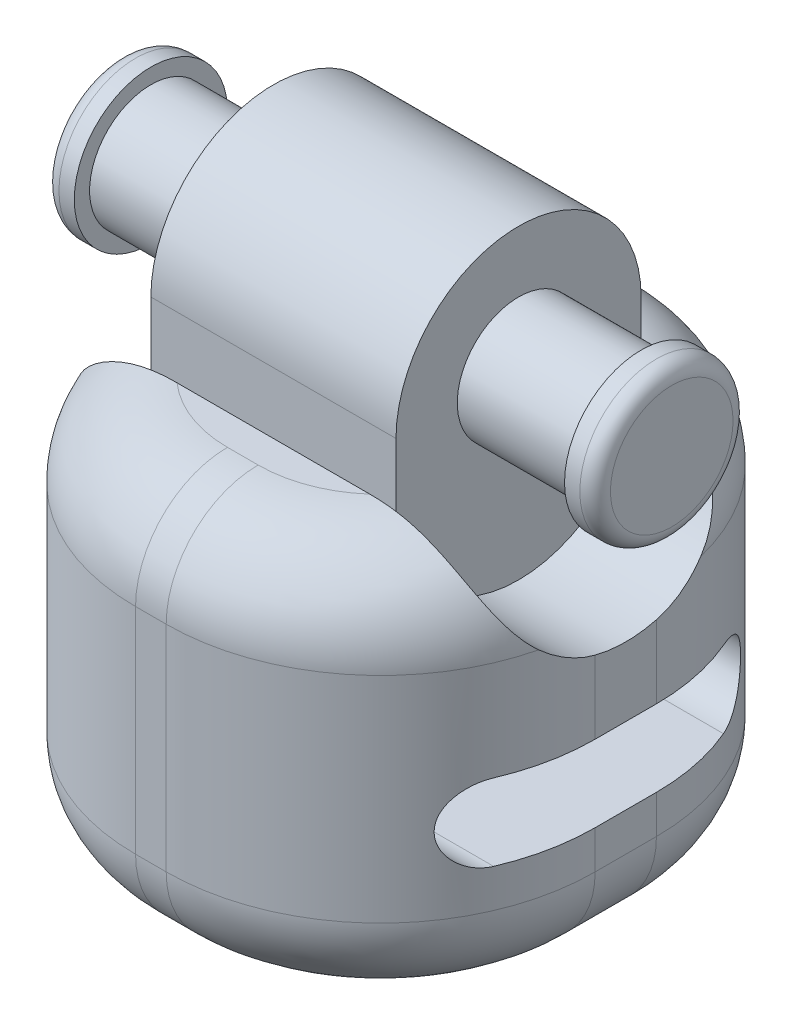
ISO-10303-21;
HEADER;
FILE_DESCRIPTION(('STEP AP214'),'2;1');
FILE_NAME('part.step','',(''),(''),'','','');
FILE_SCHEMA(('AUTOMOTIVE_DESIGN { 1 0 10303 214 1 1 1 1 }'));
ENDSEC;
DATA;
#1=APPLICATION_CONTEXT('core data for automotive mechanical design processes');
#2=APPLICATION_PROTOCOL_DEFINITION('international standard','automotive_design',2000,#1);
#3=PRODUCT_CONTEXT('',#1,'mechanical');
#4=PRODUCT('Part','Part','',(#3));
#5=PRODUCT_RELATED_PRODUCT_CATEGORY('part','',(#4));
#6=PRODUCT_DEFINITION_FORMATION('','',#4);
#7=PRODUCT_DEFINITION_CONTEXT('part definition',#1,'design');
#8=PRODUCT_DEFINITION('design','',#6,#7);
#9=PRODUCT_DEFINITION_SHAPE('','',#8);
#10=(LENGTH_UNIT() NAMED_UNIT(*) SI_UNIT(.MILLI.,.METRE.));
#11=(NAMED_UNIT(*) PLANE_ANGLE_UNIT() SI_UNIT($,.RADIAN.));
#12=(NAMED_UNIT(*) SI_UNIT($,.STERADIAN.) SOLID_ANGLE_UNIT());
#13=UNCERTAINTY_MEASURE_WITH_UNIT(LENGTH_MEASURE(1.E-05),#10,'distance_accuracy_value','');
#14=(GEOMETRIC_REPRESENTATION_CONTEXT(3) GLOBAL_UNCERTAINTY_ASSIGNED_CONTEXT((#13)) GLOBAL_UNIT_ASSIGNED_CONTEXT((#10,
#11,#12)) REPRESENTATION_CONTEXT('',''));
#15=CARTESIAN_POINT('',(0.,0.,0.));
#16=DIRECTION('',(0.,0.,1.));
#17=DIRECTION('',(1.,0.,0.));
#18=AXIS2_PLACEMENT_3D('',#15,#16,#17);
#19=CARTESIAN_POINT('',(-19.05,0.,0.));
#20=DIRECTION('',(1.,0.,0.));
#21=DIRECTION('',(0.,0.,-1.));
#22=AXIS2_PLACEMENT_3D('',#19,#20,#21);
#23=PLANE('',#22);
#24=DIRECTION('',(0.,-1.,0.));
#25=VECTOR('',#24,1.);
#26=CARTESIAN_POINT('',(-19.05,0.,-2.54000000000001));
#27=LINE('',#26,#25);
#28=CARTESIAN_POINT('',(-19.05,23.1826223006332,-2.54));
#29=VERTEX_POINT('',#28);
#30=CARTESIAN_POINT('',(-19.05,17.145,-2.54));
#31=VERTEX_POINT('',#30);
#32=EDGE_CURVE('E480',#29,#31,#27,.T.);
#33=ORIENTED_EDGE('',*,*,#32,.T.);
#34=DIRECTION('',(0.,0.,1.));
#35=VECTOR('',#34,1.);
#36=CARTESIAN_POINT('',(-19.05,17.145,0.));
#37=LINE('',#36,#35);
#38=CARTESIAN_POINT('',(-19.05,17.145,2.54));
#39=VERTEX_POINT('',#38);
#40=EDGE_CURVE('E1372',#31,#39,#37,.T.);
#41=ORIENTED_EDGE('',*,*,#40,.T.);
#42=DIRECTION('',(0.,-1.,0.));
#43=VECTOR('',#42,1.);
#44=CARTESIAN_POINT('',(-19.05,0.,2.54));
#45=LINE('',#44,#43);
#46=CARTESIAN_POINT('',(-19.05,23.1826223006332,2.54));
#47=VERTEX_POINT('',#46);
#48=EDGE_CURVE('E478',#39,#47,#45,.F.);
#49=ORIENTED_EDGE('',*,*,#48,.T.);
#50=CARTESIAN_POINT('',(-19.05,33.02,0.));
#51=DIRECTION('',(1.,0.,0.));
#52=DIRECTION('',(0.,0.,-1.));
#53=AXIS2_PLACEMENT_3D('',#50,#51,#52);
#54=CIRCLE('',#53,10.16);
#55=EDGE_CURVE('E717',#47,#29,#54,.T.);
#56=ORIENTED_EDGE('',*,*,#55,.T.);
#57=EDGE_LOOP('',(#33,#41,#49,#56));
#58=FACE_BOUND('',#57,.T.);
#59=ADVANCED_FACE('F86',(#58),#23,.F.);
#60=CARTESIAN_POINT('',(19.05,0.,0.));
#61=DIRECTION('',(1.,0.,0.));
#62=DIRECTION('',(0.,0.,-1.));
#63=AXIS2_PLACEMENT_3D('',#60,#61,#62);
#64=PLANE('',#63);
#65=DIRECTION('',(0.,0.,1.));
#66=VECTOR('',#65,1.);
#67=CARTESIAN_POINT('',(19.05,17.145,0.));
#68=LINE('',#67,#66);
#69=CARTESIAN_POINT('',(19.05,17.145,-2.54));
#70=VERTEX_POINT('',#69);
#71=CARTESIAN_POINT('',(19.05,17.145,2.54));
#72=VERTEX_POINT('',#71);
#73=EDGE_CURVE('E679',#70,#72,#68,.T.);
#74=ORIENTED_EDGE('',*,*,#73,.F.);
#75=DIRECTION('',(0.,-1.,0.));
#76=VECTOR('',#75,1.);
#77=CARTESIAN_POINT('',(19.05,0.,-2.54000000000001));
#78=LINE('',#77,#76);
#79=CARTESIAN_POINT('',(19.05,23.1826223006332,-2.54));
#80=VERTEX_POINT('',#79);
#81=EDGE_CURVE('E698',#70,#80,#78,.F.);
#82=ORIENTED_EDGE('',*,*,#81,.T.);
#83=CARTESIAN_POINT('',(19.05,33.02,0.));
#84=DIRECTION('',(1.,0.,0.));
#85=DIRECTION('',(0.,0.,-1.));
#86=AXIS2_PLACEMENT_3D('',#83,#84,#85);
#87=CIRCLE('',#86,10.16);
#88=CARTESIAN_POINT('',(19.05,23.1826223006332,2.54));
#89=VERTEX_POINT('',#88);
#90=EDGE_CURVE('E708',#89,#80,#87,.T.);
#91=ORIENTED_EDGE('',*,*,#90,.F.);
#92=DIRECTION('',(0.,-1.,0.));
#93=VECTOR('',#92,1.);
#94=CARTESIAN_POINT('',(19.05,0.,2.54));
#95=LINE('',#94,#93);
#96=EDGE_CURVE('E695',#89,#72,#95,.T.);
#97=ORIENTED_EDGE('',*,*,#96,.T.);
#98=EDGE_LOOP('',(#74,#82,#91,#97));
#99=FACE_BOUND('',#98,.T.);
#100=ADVANCED_FACE('F448',(#99),#64,.T.);
#101=CARTESIAN_POINT('',(10.16,0.,10.16));
#102=DIRECTION('',(0.,0.,-1.));
#103=DIRECTION('',(0.,1.,0.));
#104=AXIS2_PLACEMENT_3D('',#101,#102,#103);
#105=PLANE('',#104);
#106=DIRECTION('',(0.,-1.,0.));
#107=VECTOR('',#106,1.);
#108=CARTESIAN_POINT('',(-10.16,0.,10.16));
#109=LINE('',#108,#107);
#110=CARTESIAN_POINT('',(-10.16,38.1,10.16));
#111=VERTEX_POINT('',#110);
#112=CARTESIAN_POINT('',(-10.16,32.8609350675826,10.16));
#113=VERTEX_POINT('',#112);
#114=EDGE_CURVE('E716',#111,#113,#109,.T.);
#115=ORIENTED_EDGE('',*,*,#114,.T.);
#116=CARTESIAN_POINT('',(-10.16,32.8609350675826,10.16));
#117=CARTESIAN_POINT('',(-9.98054875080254,32.8892281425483,10.16));
#118=CARTESIAN_POINT('',(-9.8004691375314,32.9133471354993,10.16));
#119=CARTESIAN_POINT('',(-9.4397141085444,32.9538162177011,10.16));
#120=CARTESIAN_POINT('',(-9.25904003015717,32.970178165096,10.16));
#121=CARTESIAN_POINT('',(-8.89725025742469,32.9957921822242,10.16));
#122=CARTESIAN_POINT('',(-8.71613468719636,33.0050460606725,10.16));
#123=CARTESIAN_POINT('',(-8.35340710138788,33.0171598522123,10.16));
#124=CARTESIAN_POINT('',(-8.17179475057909,33.0200099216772,10.16));
#125=CARTESIAN_POINT('',(-7.99020833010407,33.02,10.16));
#126=B_SPLINE_CURVE_WITH_KNOTS('',3,(#116,#117,#118,#119,#120,#121,#122,#123,#124,#125),
.UNSPECIFIED.,.F.,.F.,(4,2,2,2,4),(0.,0.544913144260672,1.08899057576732,1.63292951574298,
2.17770400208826),.UNSPECIFIED.);
#127=CARTESIAN_POINT('',(-7.99020833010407,33.02,10.16));
#128=VERTEX_POINT('',#127);
#129=EDGE_CURVE('E585',#113,#128,#126,.T.);
#130=ORIENTED_EDGE('',*,*,#129,.T.);
#131=DIRECTION('',(-1.,0.,0.));
#132=VECTOR('',#131,1.);
#133=CARTESIAN_POINT('',(10.16,33.02,10.16));
#134=LINE('',#133,#132);
#135=CARTESIAN_POINT('',(7.99020833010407,33.02,10.16));
#136=VERTEX_POINT('',#135);
#137=EDGE_CURVE('E482',#136,#128,#134,.T.);
#138=ORIENTED_EDGE('',*,*,#137,.F.);
#139=CARTESIAN_POINT('',(7.99020833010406,33.02,10.16));
#140=CARTESIAN_POINT('',(8.17179475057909,33.0200099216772,10.16));
#141=CARTESIAN_POINT('',(8.35340710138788,33.0171598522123,10.16));
#142=CARTESIAN_POINT('',(8.71613468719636,33.0050460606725,10.16));
#143=CARTESIAN_POINT('',(8.89725025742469,32.9957921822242,10.16));
#144=CARTESIAN_POINT('',(9.25904003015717,32.970178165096,10.16));
#145=CARTESIAN_POINT('',(9.4397141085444,32.9538162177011,10.16));
#146=CARTESIAN_POINT('',(9.8004691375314,32.9133471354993,10.16));
#147=CARTESIAN_POINT('',(9.98054875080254,32.8892281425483,10.16));
#148=CARTESIAN_POINT('',(10.16,32.8609350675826,10.16));
#149=B_SPLINE_CURVE_WITH_KNOTS('',3,(#139,#140,#141,#142,#143,#144,#145,#146,#147,#148),
.UNSPECIFIED.,.F.,.F.,(4,2,2,2,4),(0.,0.544774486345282,1.08871342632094,1.63279085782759,
2.17770400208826),.UNSPECIFIED.);
#150=CARTESIAN_POINT('',(10.16,32.8609350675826,10.16));
#151=VERTEX_POINT('',#150);
#152=EDGE_CURVE('E918',#136,#151,#149,.T.);
#153=ORIENTED_EDGE('',*,*,#152,.T.);
#154=DIRECTION('',(0.,-1.,0.));
#155=VECTOR('',#154,1.);
#156=CARTESIAN_POINT('',(10.16,0.,10.16));
#157=LINE('',#156,#155);
#158=CARTESIAN_POINT('',(10.16,38.1,10.16));
#159=VERTEX_POINT('',#158);
#160=EDGE_CURVE('E893',#159,#151,#157,.T.);
#161=ORIENTED_EDGE('',*,*,#160,.F.);
#162=DIRECTION('',(-1.,0.,0.));
#163=VECTOR('',#162,1.);
#164=CARTESIAN_POINT('',(10.16,38.1,10.16));
#165=LINE('',#164,#163);
#166=EDGE_CURVE('E903',#159,#111,#165,.T.);
#167=ORIENTED_EDGE('',*,*,#166,.T.);
#168=EDGE_LOOP('',(#115,#130,#138,#153,#161,#167));
#169=FACE_BOUND('',#168,.T.);
#170=ADVANCED_FACE('F454',(#169),#105,.F.);
#171=CARTESIAN_POINT('',(10.16,0.,-10.16));
#172=DIRECTION('',(0.,0.,1.));
#173=DIRECTION('',(0.,-1.,0.));
#174=AXIS2_PLACEMENT_3D('',#171,#172,#173);
#175=PLANE('',#174);
#176=DIRECTION('',(0.,1.,0.));
#177=VECTOR('',#176,1.);
#178=CARTESIAN_POINT('',(-10.16,0.,-10.16));
#179=LINE('',#178,#177);
#180=CARTESIAN_POINT('',(-10.16,32.8609350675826,-10.16));
#181=VERTEX_POINT('',#180);
#182=CARTESIAN_POINT('',(-10.16,38.1,-10.16));
#183=VERTEX_POINT('',#182);
#184=EDGE_CURVE('E907',#181,#183,#179,.T.);
#185=ORIENTED_EDGE('',*,*,#184,.T.);
#186=DIRECTION('',(-1.,0.,0.));
#187=VECTOR('',#186,1.);
#188=CARTESIAN_POINT('',(10.16,38.1,-10.16));
#189=LINE('',#188,#187);
#190=CARTESIAN_POINT('',(10.16,38.1,-10.16));
#191=VERTEX_POINT('',#190);
#192=EDGE_CURVE('E913',#191,#183,#189,.T.);
#193=ORIENTED_EDGE('',*,*,#192,.F.);
#194=DIRECTION('',(0.,1.,0.));
#195=VECTOR('',#194,1.);
#196=CARTESIAN_POINT('',(10.16,0.,-10.16));
#197=LINE('',#196,#195);
#198=CARTESIAN_POINT('',(10.16,32.8609350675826,-10.16));
#199=VERTEX_POINT('',#198);
#200=EDGE_CURVE('E898',#199,#191,#197,.T.);
#201=ORIENTED_EDGE('',*,*,#200,.F.);
#202=CARTESIAN_POINT('',(10.16,32.8609350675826,-10.16));
#203=CARTESIAN_POINT('',(9.98054875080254,32.8892281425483,-10.16));
#204=CARTESIAN_POINT('',(9.8004691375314,32.9133471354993,-10.16));
#205=CARTESIAN_POINT('',(9.43971410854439,32.9538162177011,-10.16));
#206=CARTESIAN_POINT('',(9.25904003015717,32.970178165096,-10.16));
#207=CARTESIAN_POINT('',(8.89725025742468,32.9957921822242,-10.16));
#208=CARTESIAN_POINT('',(8.71613468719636,33.0050460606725,-10.16));
#209=CARTESIAN_POINT('',(8.35340710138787,33.0171598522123,-10.16));
#210=CARTESIAN_POINT('',(8.17179475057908,33.0200099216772,-10.16));
#211=CARTESIAN_POINT('',(7.99020833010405,33.02,-10.16));
#212=B_SPLINE_CURVE_WITH_KNOTS('',3,(#202,#203,#204,#205,#206,#207,#208,#209,#210,#211),
.UNSPECIFIED.,.F.,.F.,(4,2,2,2,4),(0.,0.544913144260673,1.08899057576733,1.63292951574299,
2.17770400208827),.UNSPECIFIED.);
#213=CARTESIAN_POINT('',(7.99020833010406,33.02,-10.16));
#214=VERTEX_POINT('',#213);
#215=EDGE_CURVE('E619',#199,#214,#212,.T.);
#216=ORIENTED_EDGE('',*,*,#215,.T.);
#217=DIRECTION('',(-1.,0.,0.));
#218=VECTOR('',#217,1.);
#219=CARTESIAN_POINT('',(10.16,33.02,-10.16));
#220=LINE('',#219,#218);
#221=CARTESIAN_POINT('',(-7.99020833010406,33.02,-10.16));
#222=VERTEX_POINT('',#221);
#223=EDGE_CURVE('E788',#214,#222,#220,.T.);
#224=ORIENTED_EDGE('',*,*,#223,.T.);
#225=CARTESIAN_POINT('',(-7.99020833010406,33.02,-10.16));
#226=CARTESIAN_POINT('',(-8.17179475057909,33.0200099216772,-10.16));
#227=CARTESIAN_POINT('',(-8.35340710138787,33.0171598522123,-10.16));
#228=CARTESIAN_POINT('',(-8.71613468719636,33.0050460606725,-10.16));
#229=CARTESIAN_POINT('',(-8.89725025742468,32.9957921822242,-10.16));
#230=CARTESIAN_POINT('',(-9.25904003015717,32.970178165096,-10.16));
#231=CARTESIAN_POINT('',(-9.43971410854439,32.9538162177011,-10.16));
#232=CARTESIAN_POINT('',(-9.8004691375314,32.9133471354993,-10.16));
#233=CARTESIAN_POINT('',(-9.98054875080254,32.8892281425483,-10.16));
#234=CARTESIAN_POINT('',(-10.16,32.8609350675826,-10.16));
#235=B_SPLINE_CURVE_WITH_KNOTS('',3,(#225,#226,#227,#228,#229,#230,#231,#232,#233,#234),
.UNSPECIFIED.,.F.,.F.,(4,2,2,2,4),(0.,0.544774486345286,1.08871342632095,1.63279085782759,
2.17770400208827),.UNSPECIFIED.);
#236=EDGE_CURVE('E625',#222,#181,#235,.T.);
#237=ORIENTED_EDGE('',*,*,#236,.T.);
#238=EDGE_LOOP('',(#185,#193,#201,#216,#224,#237));
#239=FACE_BOUND('',#238,.T.);
#240=ADVANCED_FACE('F611',(#239),#175,.F.);
#241=CARTESIAN_POINT('',(10.16,38.1,0.));
#242=DIRECTION('',(-1.,0.,0.));
#243=DIRECTION('',(0.,0.,1.));
#244=AXIS2_PLACEMENT_3D('',#241,#242,#243);
#245=CYLINDRICAL_SURFACE('',#244,10.16);
#246=CARTESIAN_POINT('',(-10.16,38.1,0.));
#247=DIRECTION('',(1.,0.,0.));
#248=DIRECTION('',(0.,0.,-1.));
#249=AXIS2_PLACEMENT_3D('',#246,#247,#248);
#250=CIRCLE('',#249,10.16);
#251=EDGE_CURVE('E894',#111,#183,#250,.F.);
#252=ORIENTED_EDGE('',*,*,#251,.F.);
#253=ORIENTED_EDGE('',*,*,#166,.F.);
#254=CARTESIAN_POINT('',(10.16,38.1,0.));
#255=DIRECTION('',(1.,0.,0.));
#256=DIRECTION('',(0.,0.,-1.));
#257=AXIS2_PLACEMENT_3D('',#254,#255,#256);
#258=CIRCLE('',#257,10.16);
#259=EDGE_CURVE('E900',#159,#191,#258,.F.);
#260=ORIENTED_EDGE('',*,*,#259,.T.);
#261=ORIENTED_EDGE('',*,*,#192,.T.);
#262=EDGE_LOOP('',(#252,#253,#260,#261));
#263=FACE_BOUND('',#262,.T.);
#264=ADVANCED_FACE('F607',(#263),#245,.T.);
#265=CARTESIAN_POINT('',(10.16,0.,0.));
#266=DIRECTION('',(1.,0.,0.));
#267=DIRECTION('',(0.,0.,-1.));
#268=AXIS2_PLACEMENT_3D('',#265,#266,#267);
#269=PLANE('',#268);
#270=CARTESIAN_POINT('',(10.16,38.1,0.));
#271=DIRECTION('',(1.,0.,0.));
#272=DIRECTION('',(0.,0.,-1.));
#273=AXIS2_PLACEMENT_3D('',#270,#271,#272);
#274=CIRCLE('',#273,5.08000000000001);
#275=CARTESIAN_POINT('',(10.16,38.1,-5.08000000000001));
#276=VERTEX_POINT('',#275);
#277=EDGE_CURVE('E890',#276,#276,#274,.T.);
#278=ORIENTED_EDGE('',*,*,#277,.F.);
#279=EDGE_LOOP('',(#278));
#280=FACE_BOUND('',#279,.T.);
#281=ORIENTED_EDGE('',*,*,#160,.T.);
#282=CARTESIAN_POINT('',(10.16,32.8609350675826,10.16));
#283=CARTESIAN_POINT('',(10.16,32.8609630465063,10.1597928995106));
#284=CARTESIAN_POINT('',(10.16,32.8609910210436,10.1595857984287));
#285=CARTESIAN_POINT('',(10.16,32.8610469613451,10.1591715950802));
#286=CARTESIAN_POINT('',(10.16,32.8610749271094,10.1589644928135));
#287=CARTESIAN_POINT('',(10.16,32.8611028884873,10.1587573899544));
#288=B_SPLINE_CURVE_WITH_KNOTS('',3,(#282,#283,#284,#285,#286,#287),.UNSPECIFIED.,.F.,.F.,(4,2,
4),(0.,0.000626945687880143,0.00125389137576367),.UNSPECIFIED.);
#289=CARTESIAN_POINT('',(10.16,32.8611028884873,10.1587573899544));
#290=VERTEX_POINT('',#289);
#291=EDGE_CURVE('E925',#151,#290,#288,.T.);
#292=ORIENTED_EDGE('',*,*,#291,.T.);
#293=CARTESIAN_POINT('',(10.16,33.02,0.));
#294=DIRECTION('',(1.,0.,0.));
#295=DIRECTION('',(0.,0.,-1.));
#296=AXIS2_PLACEMENT_3D('',#293,#294,#295);
#297=CIRCLE('',#296,10.16);
#298=CARTESIAN_POINT('',(10.16,32.8611028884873,-10.1587573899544));
#299=VERTEX_POINT('',#298);
#300=EDGE_CURVE('E896',#290,#299,#297,.T.);
#301=ORIENTED_EDGE('',*,*,#300,.T.);
#302=CARTESIAN_POINT('',(10.16,32.8611028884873,-10.1587573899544));
#303=CARTESIAN_POINT('',(10.16,32.8610749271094,-10.1589644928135));
#304=CARTESIAN_POINT('',(10.16,32.8610469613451,-10.1591715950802));
#305=CARTESIAN_POINT('',(10.16,32.8609910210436,-10.1595857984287));
#306=CARTESIAN_POINT('',(10.16,32.8609630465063,-10.1597928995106));
#307=CARTESIAN_POINT('',(10.16,32.8609350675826,-10.16));
#308=B_SPLINE_CURVE_WITH_KNOTS('',3,(#302,#303,#304,#305,#306,#307),.UNSPECIFIED.,.F.,.F.,(4,2,
4),(0.,0.000626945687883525,0.00125389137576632),.UNSPECIFIED.);
#309=EDGE_CURVE('E926',#299,#199,#308,.T.);
#310=ORIENTED_EDGE('',*,*,#309,.T.);
#311=ORIENTED_EDGE('',*,*,#200,.T.);
#312=ORIENTED_EDGE('',*,*,#259,.F.);
#313=EDGE_LOOP('',(#281,#292,#301,#310,#311,#312));
#314=FACE_BOUND('',#313,.T.);
#315=ADVANCED_FACE('F603',(#280,#314),#269,.T.);
#316=CARTESIAN_POINT('',(-10.16,0.,0.));
#317=DIRECTION('',(1.,0.,0.));
#318=DIRECTION('',(0.,0.,-1.));
#319=AXIS2_PLACEMENT_3D('',#316,#317,#318);
#320=PLANE('',#319);
#321=CARTESIAN_POINT('',(-10.16,38.1,0.));
#322=DIRECTION('',(1.,0.,0.));
#323=DIRECTION('',(0.,0.,-1.));
#324=AXIS2_PLACEMENT_3D('',#321,#322,#323);
#325=CIRCLE('',#324,5.08000000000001);
#326=CARTESIAN_POINT('',(-10.16,38.1,-5.08000000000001));
#327=VERTEX_POINT('',#326);
#328=EDGE_CURVE('E796',#327,#327,#325,.F.);
#329=ORIENTED_EDGE('',*,*,#328,.F.);
#330=EDGE_LOOP('',(#329));
#331=FACE_BOUND('',#330,.T.);
#332=ORIENTED_EDGE('',*,*,#114,.F.);
#333=ORIENTED_EDGE('',*,*,#251,.T.);
#334=ORIENTED_EDGE('',*,*,#184,.F.);
#335=CARTESIAN_POINT('',(-10.16,32.8609350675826,-10.16));
#336=CARTESIAN_POINT('',(-10.16,32.8609630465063,-10.1597928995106));
#337=CARTESIAN_POINT('',(-10.16,32.8609910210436,-10.1595857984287));
#338=CARTESIAN_POINT('',(-10.16,32.8610469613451,-10.1591715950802));
#339=CARTESIAN_POINT('',(-10.16,32.8610749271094,-10.1589644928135));
#340=CARTESIAN_POINT('',(-10.16,32.8611028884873,-10.1587573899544));
#341=B_SPLINE_CURVE_WITH_KNOTS('',3,(#335,#336,#337,#338,#339,#340),.UNSPECIFIED.,.F.,.F.,(4,2,
4),(0.,0.000626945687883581,0.00125389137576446),.UNSPECIFIED.);
#342=CARTESIAN_POINT('',(-10.16,32.8611028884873,-10.1587573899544));
#343=VERTEX_POINT('',#342);
#344=EDGE_CURVE('E586',#181,#343,#341,.T.);
#345=ORIENTED_EDGE('',*,*,#344,.T.);
#346=CARTESIAN_POINT('',(-10.16,33.02,0.));
#347=DIRECTION('',(1.,0.,0.));
#348=DIRECTION('',(0.,0.,-1.));
#349=AXIS2_PLACEMENT_3D('',#346,#347,#348);
#350=CIRCLE('',#349,10.16);
#351=CARTESIAN_POINT('',(-10.16,32.8611028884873,10.1587573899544));
#352=VERTEX_POINT('',#351);
#353=EDGE_CURVE('E905',#352,#343,#350,.T.);
#354=ORIENTED_EDGE('',*,*,#353,.F.);
#355=CARTESIAN_POINT('',(-10.16,32.8611028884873,10.1587573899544));
#356=CARTESIAN_POINT('',(-10.16,32.8610749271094,10.1589644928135));
#357=CARTESIAN_POINT('',(-10.16,32.8610469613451,10.1591715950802));
#358=CARTESIAN_POINT('',(-10.16,32.8609910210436,10.1595857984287));
#359=CARTESIAN_POINT('',(-10.16,32.8609630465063,10.1597928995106));
#360=CARTESIAN_POINT('',(-10.16,32.8609350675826,10.16));
#361=B_SPLINE_CURVE_WITH_KNOTS('',3,(#355,#356,#357,#358,#359,#360),.UNSPECIFIED.,.F.,.F.,(4,2,
4),(0.,0.000626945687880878,0.00125389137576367),.UNSPECIFIED.);
#362=EDGE_CURVE('E577',#352,#113,#361,.T.);
#363=ORIENTED_EDGE('',*,*,#362,.T.);
#364=EDGE_LOOP('',(#332,#333,#334,#345,#354,#363));
#365=FACE_BOUND('',#364,.T.);
#366=ADVANCED_FACE('F598',(#331,#365),#320,.F.);
#367=CARTESIAN_POINT('',(19.05,33.02,0.));
#368=DIRECTION('',(-1.,0.,0.));
#369=DIRECTION('',(0.,0.,1.));
#370=AXIS2_PLACEMENT_3D('',#367,#368,#369);
#371=CYLINDRICAL_SURFACE('',#370,10.16);
#372=ORIENTED_EDGE('',*,*,#353,.T.);
#373=CARTESIAN_POINT('',(-10.16,32.8611028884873,-10.1587573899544));
#374=CARTESIAN_POINT('',(-10.2830561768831,32.8417595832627,-10.158452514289));
#375=CARTESIAN_POINT('',(-10.4058019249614,32.8204774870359,-10.1580669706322));
#376=CARTESIAN_POINT('',(-10.6505412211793,32.7739036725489,-10.157046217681));
#377=CARTESIAN_POINT('',(-10.7725346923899,32.7486115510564,-10.1564109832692));
#378=CARTESIAN_POINT('',(-11.1372343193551,32.6665100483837,-10.1539977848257));
#379=CARTESIAN_POINT('',(-11.3785767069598,32.6034883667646,-10.1517124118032));
#380=CARTESIAN_POINT('',(-11.8570441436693,32.4599891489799,-10.1448095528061));
#381=CARTESIAN_POINT('',(-12.094148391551,32.379442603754,-10.1401827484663));
#382=CARTESIAN_POINT('',(-12.5615813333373,32.2008932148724,-10.1273227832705));
#383=CARTESIAN_POINT('',(-12.7919105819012,32.1028918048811,-10.1190899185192));
#384=CARTESIAN_POINT('',(-13.2849981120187,31.8705249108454,-10.0955584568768));
#385=CARTESIAN_POINT('',(-13.5461326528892,31.7327891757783,-10.0792549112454));
#386=CARTESIAN_POINT('',(-14.0544137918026,31.4347297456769,-10.0366903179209));
#387=CARTESIAN_POINT('',(-14.3015572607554,31.274401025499,-10.0104270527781));
#388=CARTESIAN_POINT('',(-14.7790085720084,30.9337831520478,-9.94501300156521));
#389=CARTESIAN_POINT('',(-15.0093545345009,30.75354168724,-9.90589258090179));
#390=CARTESIAN_POINT('',(-15.4518745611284,30.3757561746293,-9.8118000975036));
#391=CARTESIAN_POINT('',(-15.664052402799,30.1782157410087,-9.75683134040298));
#392=CARTESIAN_POINT('',(-16.0421465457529,29.7962069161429,-9.63677475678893));
#393=CARTESIAN_POINT('',(-16.2104824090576,29.6134140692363,-9.57395457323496));
#394=CARTESIAN_POINT('',(-16.5314168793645,29.2401464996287,-9.4328202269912));
#395=CARTESIAN_POINT('',(-16.6840166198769,29.0496723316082,-9.35450718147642));
#396=CARTESIAN_POINT('',(-16.9729338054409,28.6638584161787,-9.18119646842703));
#397=CARTESIAN_POINT('',(-17.1092436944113,28.4685164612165,-9.08619110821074));
#398=CARTESIAN_POINT('',(-17.3651248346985,28.0761210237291,-8.87878845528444));
#399=CARTESIAN_POINT('',(-17.4846978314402,27.8790677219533,-8.76639297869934));
#400=CARTESIAN_POINT('',(-17.6976761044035,27.5028485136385,-8.53412790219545));
#401=CARTESIAN_POINT('',(-17.7924355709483,27.3235699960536,-8.41567836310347));
#402=CARTESIAN_POINT('',(-17.9679860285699,26.9684837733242,-8.16407312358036));
#403=CARTESIAN_POINT('',(-18.0487756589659,26.7926764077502,-8.03091599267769));
#404=CARTESIAN_POINT('',(-18.1965462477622,26.4471498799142,-7.75065405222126));
#405=CARTESIAN_POINT('',(-18.2635553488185,26.2774189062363,-7.60357858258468));
#406=CARTESIAN_POINT('',(-18.3844669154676,25.9457634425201,-7.29601705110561));
#407=CARTESIAN_POINT('',(-18.438377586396,25.783834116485,-7.13553946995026));
#408=CARTESIAN_POINT('',(-18.497742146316,25.5883371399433,-6.92814043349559));
#409=CARTESIAN_POINT('',(-18.5090297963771,25.5502330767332,-6.88704113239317));
#410=CARTESIAN_POINT('',(-18.5308683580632,25.4746520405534,-6.80415038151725));
#411=CARTESIAN_POINT('',(-18.5414199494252,25.4371745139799,-6.76235961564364));
#412=CARTESIAN_POINT('',(-18.5516161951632,25.4,-6.72020833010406));
#413=B_SPLINE_CURVE_WITH_KNOTS('',3,(#373,#374,#375,#376,#377,#378,#379,#380,#381,#382,#383,
#384,#385,#386,#387,#388,#389,#390,#391,#392,#393,#394,#395,#396,#397,#398,#399,#400,#401,#402,
#403,#404,#405,#406,#407,#408,#409,#410,#411,#412),.UNSPECIFIED.,.F.,.F.,(4,2,2,2,2,2,2,2,2,2,2,
2,2,2,2,2,2,2,2,4),(0.,0.373673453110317,0.747384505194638,1.49505800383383,2.24573075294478,
2.99634187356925,3.88203770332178,4.76793084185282,5.65174657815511,6.53537810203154,
7.30329981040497,8.07116616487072,8.83938732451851,9.60752830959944,10.3111695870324,
11.014879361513,11.7171374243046,12.4189544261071,12.5904595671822,12.7618041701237),.UNSPECIFIED.);
#414=CARTESIAN_POINT('',(-18.5516161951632,25.4,-6.72020833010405));
#415=VERTEX_POINT('',#414);
#416=EDGE_CURVE('E554',#343,#415,#413,.T.);
#417=ORIENTED_EDGE('',*,*,#416,.T.);
#418=CARTESIAN_POINT('',(-17.3343705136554,33.02,-10.16));
#419=CARTESIAN_POINT('',(-17.33436741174,32.883487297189,-10.1600007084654));
#420=CARTESIAN_POINT('',(-17.3356761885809,32.7469932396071,-10.1572481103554));
#421=CARTESIAN_POINT('',(-17.3408865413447,32.4742824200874,-10.1462513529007));
#422=CARTESIAN_POINT('',(-17.3447879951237,32.3380656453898,-10.1380074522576));
#423=CARTESIAN_POINT('',(-17.3603276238,31.930368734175,-10.1050768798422));
#424=CARTESIAN_POINT('',(-17.3758011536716,31.6596437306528,-10.0721912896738));
#425=CARTESIAN_POINT('',(-17.4162215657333,31.1237285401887,-9.98514594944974));
#426=CARTESIAN_POINT('',(-17.4411233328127,30.8585182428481,-9.93108747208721));
#427=CARTESIAN_POINT('',(-17.4993824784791,30.3341024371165,-9.80226788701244));
#428=CARTESIAN_POINT('',(-17.5327406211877,30.0748974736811,-9.72750490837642));
#429=CARTESIAN_POINT('',(-17.6065355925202,29.564657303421,-9.55815559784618));
#430=CARTESIAN_POINT('',(-17.6469589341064,29.3136075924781,-9.46360696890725));
#431=CARTESIAN_POINT('',(-17.7334508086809,28.8205002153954,-9.25534782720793));
#432=CARTESIAN_POINT('',(-17.7795213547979,28.5784457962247,-9.14163047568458));
#433=CARTESIAN_POINT('',(-17.87574764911,28.1043694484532,-8.89570562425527));
#434=CARTESIAN_POINT('',(-17.9259085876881,27.872360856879,-8.76347447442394));
#435=CARTESIAN_POINT('',(-18.0285867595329,27.4198306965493,-8.48143821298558));
#436=CARTESIAN_POINT('',(-18.0811040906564,27.1993096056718,-8.33163237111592));
#437=CARTESIAN_POINT('',(-18.1901264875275,26.7572974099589,-8.00526743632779));
#438=CARTESIAN_POINT('',(-18.2466742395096,26.5366214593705,-7.82761716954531));
#439=CARTESIAN_POINT('',(-18.3584474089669,26.1107517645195,-7.45439670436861));
#440=CARTESIAN_POINT('',(-18.4136732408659,25.9055531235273,-7.25883221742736));
#441=CARTESIAN_POINT('',(-18.5207504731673,25.5119965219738,-6.85096387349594));
#442=CARTESIAN_POINT('',(-18.5726052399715,25.3236216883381,-6.63867719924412));
#443=CARTESIAN_POINT('',(-18.671032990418,24.9647511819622,-6.19832567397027));
#444=CARTESIAN_POINT('',(-18.7176058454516,24.7942559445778,-5.97026043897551));
#445=CARTESIAN_POINT('',(-18.804472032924,24.4690673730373,-5.49471032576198));
#446=CARTESIAN_POINT('',(-18.8446126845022,24.3147818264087,-5.24691788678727));
#447=CARTESIAN_POINT('',(-18.9154900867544,24.0276380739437,-4.73797363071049));
#448=CARTESIAN_POINT('',(-18.9462282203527,23.8947767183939,-4.47682378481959));
#449=CARTESIAN_POINT('',(-18.9967121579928,23.6511246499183,-3.94165099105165));
#450=CARTESIAN_POINT('',(-19.0163995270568,23.5404532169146,-3.66756776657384));
#451=CARTESIAN_POINT('',(-19.0363855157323,23.3925451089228,-3.24955670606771));
#452=CARTESIAN_POINT('',(-19.0414568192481,23.3462393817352,-3.10899644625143));
#453=CARTESIAN_POINT('',(-19.0482653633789,23.2597859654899,-2.82590281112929));
#454=CARTESIAN_POINT('',(-19.0500023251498,23.2196387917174,-2.68336927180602));
#455=CARTESIAN_POINT('',(-19.05,23.1826223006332,-2.54));
#456=B_SPLINE_CURVE_WITH_KNOTS('',3,(#418,#419,#420,#421,#422,#423,#424,#425,#426,#427,#428,
#429,#430,#431,#432,#433,#434,#435,#436,#437,#438,#439,#440,#441,#442,#443,#444,#445,#446,#447,
#448,#449,#450,#451,#452,#453,#454,#455),.UNSPECIFIED.,.F.,.F.,(4,2,2,2,2,2,2,2,2,2,2,2,2,2,2,2,
2,2,4),(0.,0.409467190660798,0.818915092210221,1.63721818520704,2.45165411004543,
3.26616365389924,4.07913499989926,4.89239700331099,5.7067075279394,6.52105190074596,
7.38673084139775,8.252134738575,9.11666071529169,9.98120773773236,10.863938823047,
11.7465400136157,12.6337653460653,13.0778441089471,13.5219600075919),.UNSPECIFIED.);
#457=EDGE_CURVE('E499',#415,#29,#456,.T.);
#458=ORIENTED_EDGE('',*,*,#457,.T.);
#459=ORIENTED_EDGE('',*,*,#55,.F.);
#460=CARTESIAN_POINT('',(-19.05,23.1826223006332,2.54));
#461=CARTESIAN_POINT('',(-19.0500016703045,23.2167158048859,2.67204717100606));
#462=CARTESIAN_POINT('',(-19.0485285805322,23.25346511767,2.80338732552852));
#463=CARTESIAN_POINT('',(-19.0427437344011,23.3321969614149,3.06441772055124));
#464=CARTESIAN_POINT('',(-19.0384321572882,23.3741791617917,3.19410806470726));
#465=CARTESIAN_POINT('',(-19.0214153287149,23.5077886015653,3.58015626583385));
#466=CARTESIAN_POINT('',(-19.0046276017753,23.6071369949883,3.83371689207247));
#467=CARTESIAN_POINT('',(-18.961401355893,23.8249585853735,4.330123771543));
#468=CARTESIAN_POINT('',(-18.9350089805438,23.9433388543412,4.573015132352));
#469=CARTESIAN_POINT('',(-18.8738772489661,24.1985673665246,5.04782885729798));
#470=CARTESIAN_POINT('',(-18.8391367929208,24.3354180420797,5.2797497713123));
#471=CARTESIAN_POINT('',(-18.7628625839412,24.6261393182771,5.73066336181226));
#472=CARTESIAN_POINT('',(-18.7213453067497,24.7799683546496,5.94968568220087));
#473=CARTESIAN_POINT('',(-18.6329892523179,25.1038833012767,6.37432627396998));
#474=CARTESIAN_POINT('',(-18.5861486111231,25.2739749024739,6.57993981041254));
#475=CARTESIAN_POINT('',(-18.4887036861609,25.6295369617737,6.9769450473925));
#476=CARTESIAN_POINT('',(-18.4380945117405,25.8150274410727,7.16831759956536));
#477=CARTESIAN_POINT('',(-18.334823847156,26.2001549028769,7.5356577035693));
#478=CARTESIAN_POINT('',(-18.2821622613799,26.3997925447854,7.71162453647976));
#479=CARTESIAN_POINT('',(-18.1728467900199,26.8263335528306,8.05883414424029));
#480=CARTESIAN_POINT('',(-18.1161666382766,27.0541678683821,8.22892670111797));
#481=CARTESIAN_POINT('',(-18.0044736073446,27.5234875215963,8.54954331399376));
#482=CARTESIAN_POINT('',(-17.9494601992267,27.7649684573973,8.70007362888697));
#483=CARTESIAN_POINT('',(-17.8431893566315,28.2600878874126,8.98051752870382));
#484=CARTESIAN_POINT('',(-17.7919281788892,28.5137138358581,9.11045181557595));
#485=CARTESIAN_POINT('',(-17.6950965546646,29.0319007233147,9.34890396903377));
#486=CARTESIAN_POINT('',(-17.6495261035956,29.296461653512,9.45742185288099));
#487=CARTESIAN_POINT('',(-17.5652640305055,29.8393092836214,9.6536755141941));
#488=CARTESIAN_POINT('',(-17.5266978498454,30.1177501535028,9.74104019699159));
#489=CARTESIAN_POINT('',(-17.4591287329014,30.6821801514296,9.89168935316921));
#490=CARTESIAN_POINT('',(-17.4301248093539,30.968168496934,9.95497631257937));
#491=CARTESIAN_POINT('',(-17.3829378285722,31.5470058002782,10.0569702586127));
#492=CARTESIAN_POINT('',(-17.3648124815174,31.8398829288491,10.0955462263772));
#493=CARTESIAN_POINT('',(-17.3465952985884,32.2812532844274,10.1341858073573));
#494=CARTESIAN_POINT('',(-17.3420180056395,32.428787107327,10.1438616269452));
#495=CARTESIAN_POINT('',(-17.3359033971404,32.7242060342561,10.156769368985));
#496=CARTESIAN_POINT('',(-17.3343662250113,32.8720911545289,10.1600009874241));
#497=CARTESIAN_POINT('',(-17.3343705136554,33.02,10.16));
#498=B_SPLINE_CURVE_WITH_KNOTS('',3,(#460,#461,#462,#463,#464,#465,#466,#467,#468,#469,#470,
#471,#472,#473,#474,#475,#476,#477,#478,#479,#480,#481,#482,#483,#484,#485,#486,#487,#488,#489,
#490,#491,#492,#493,#494,#495,#496,#497),.UNSPECIFIED.,.F.,.F.,(4,2,2,2,2,2,2,2,2,2,2,2,2,2,2,2,
2,2,4),(0.,0.409057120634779,0.818088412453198,1.63545452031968,2.44894450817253,
3.2625417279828,4.0741896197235,4.88612258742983,5.69912825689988,6.51217184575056,
7.38093541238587,8.24942033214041,9.11702668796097,9.98463234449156,10.8665052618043,
11.7482871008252,12.6347063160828,13.0783217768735,13.5219581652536),.UNSPECIFIED.);
#499=CARTESIAN_POINT('',(-18.5516161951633,25.3999999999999,6.72020833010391));
#500=VERTEX_POINT('',#499);
#501=EDGE_CURVE('E492',#47,#500,#498,.T.);
#502=ORIENTED_EDGE('',*,*,#501,.T.);
#503=CARTESIAN_POINT('',(-18.5516161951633,25.4,6.72020833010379));
#504=CARTESIAN_POINT('',(-18.5311747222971,25.4745285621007,6.80471765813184));
#505=CARTESIAN_POINT('',(-18.5093009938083,25.5502848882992,6.88778071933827));
#506=CARTESIAN_POINT('',(-18.4625936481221,25.7040738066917,7.05091402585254));
#507=CARTESIAN_POINT('',(-18.4377600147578,25.7821064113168,7.13098425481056));
#508=CARTESIAN_POINT('',(-18.3586866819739,26.0193181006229,7.36652371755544));
#509=CARTESIAN_POINT('',(-18.2998667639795,26.1816398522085,7.517354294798));
#510=CARTESIAN_POINT('',(-18.1696340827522,26.5123528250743,7.80538987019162));
#511=CARTESIAN_POINT('',(-18.0982536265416,26.680727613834,7.94262844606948));
#512=CARTESIAN_POINT('',(-17.9423942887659,27.0219752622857,8.2033772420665));
#513=CARTESIAN_POINT('',(-17.8579163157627,27.194847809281,8.3268884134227));
#514=CARTESIAN_POINT('',(-17.6755155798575,27.5432144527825,8.56004746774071));
#515=CARTESIAN_POINT('',(-17.5775755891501,27.7187116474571,8.66967723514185));
#516=CARTESIAN_POINT('',(-17.3682841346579,28.0699227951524,8.87489184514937));
#517=CARTESIAN_POINT('',(-17.256932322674,28.2456367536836,8.97047632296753));
#518=CARTESIAN_POINT('',(-17.0209687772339,28.5950405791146,9.14788073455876));
#519=CARTESIAN_POINT('',(-16.8963592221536,28.7687307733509,9.22970292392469));
#520=CARTESIAN_POINT('',(-16.6341630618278,29.1119557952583,9.38018703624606));
#521=CARTESIAN_POINT('',(-16.4965764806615,29.281490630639,9.4488489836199));
#522=CARTESIAN_POINT('',(-16.2077122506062,29.6156948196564,9.57436321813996));
#523=CARTESIAN_POINT('',(-16.0563328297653,29.7803137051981,9.63111545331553));
#524=CARTESIAN_POINT('',(-15.7414524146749,30.1012820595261,9.73319339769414));
#525=CARTESIAN_POINT('',(-15.5779513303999,30.2576314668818,9.77851902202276));
#526=CARTESIAN_POINT('',(-15.2395327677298,30.5603342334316,9.85901538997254));
#527=CARTESIAN_POINT('',(-15.0646127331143,30.706685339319,9.89418385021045));
#528=CARTESIAN_POINT('',(-14.7042588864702,30.9878234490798,9.95573066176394));
#529=CARTESIAN_POINT('',(-14.5188248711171,31.1226102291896,9.98210884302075));
#530=CARTESIAN_POINT('',(-14.125749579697,31.3879033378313,10.0290181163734));
#531=CARTESIAN_POINT('',(-13.9174517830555,31.517526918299,10.0490428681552));
#532=CARTESIAN_POINT('',(-13.4913175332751,31.761005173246,10.0824422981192));
#533=CARTESIAN_POINT('',(-13.2734801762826,31.8748583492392,10.0958163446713));
#534=CARTESIAN_POINT('',(-12.8296357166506,32.0860554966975,10.1175406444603));
#535=CARTESIAN_POINT('',(-12.6036262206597,32.1833945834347,10.1258894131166));
#536=CARTESIAN_POINT('',(-12.1450406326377,32.3611768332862,10.1390086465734));
#537=CARTESIAN_POINT('',(-11.9124660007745,32.4416237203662,10.1437799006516));
#538=CARTESIAN_POINT('',(-11.4287136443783,32.589889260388,10.151179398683));
#539=CARTESIAN_POINT('',(-11.1772319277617,32.6567246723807,10.1536697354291));
#540=CARTESIAN_POINT('',(-10.7973496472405,32.7433504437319,10.156272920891));
#541=CARTESIAN_POINT('',(-10.6704542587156,32.769927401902,10.1569517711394));
#542=CARTESIAN_POINT('',(-10.4158183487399,32.8187375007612,10.1580352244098));
#543=CARTESIAN_POINT('',(-10.2880777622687,32.8409703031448,10.1584398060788));
#544=CARTESIAN_POINT('',(-10.16,32.8611028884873,10.1587573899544));
#545=B_SPLINE_CURVE_WITH_KNOTS('',3,(#503,#504,#505,#506,#507,#508,#509,#510,#511,#512,#513,
#514,#515,#516,#517,#518,#519,#520,#521,#522,#523,#524,#525,#526,#527,#528,#529,#530,#531,#532,
#533,#534,#535,#536,#537,#538,#539,#540,#541,#542,#543,#544),.UNSPECIFIED.,.F.,.F.,(4,2,2,2,2,2,
2,2,2,2,2,2,2,2,2,2,2,2,2,2,4),(0.,0.343500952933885,0.687003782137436,1.3738773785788,
2.05900942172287,2.7440939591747,3.43006353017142,4.11605091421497,4.80192575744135,
5.48779932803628,6.17922257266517,6.87065095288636,7.56223464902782,8.25383172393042,
8.99148341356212,9.72920514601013,10.46714471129,11.2049214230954,11.9848210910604,
12.373708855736,12.7626268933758),.UNSPECIFIED.);
#546=EDGE_CURVE('E547',#500,#352,#545,.T.);
#547=ORIENTED_EDGE('',*,*,#546,.T.);
#548=EDGE_LOOP('',(#372,#417,#458,#459,#502,#547));
#549=FACE_BOUND('',#548,.T.);
#550=ADVANCED_FACE('F471',(#549),#371,.F.);
#551=CARTESIAN_POINT('',(19.05,0.,0.));
#552=DIRECTION('',(0.,1.,0.));
#553=DIRECTION('',(0.,0.,1.));
#554=AXIS2_PLACEMENT_3D('',#551,#552,#553);
#555=PLANE('',#554);
#556=CARTESIAN_POINT('',(1.27,0.,-2.54));
#557=DIRECTION('',(0.,1.,0.));
#558=DIRECTION('',(0.,0.,1.));
#559=AXIS2_PLACEMENT_3D('',#556,#557,#558);
#560=CIRCLE('',#559,10.16);
#561=CARTESIAN_POINT('',(1.27,0.,-12.7));
#562=VERTEX_POINT('',#561);
#563=CARTESIAN_POINT('',(11.43,0.,-2.54));
#564=VERTEX_POINT('',#563);
#565=EDGE_CURVE('E738',#562,#564,#560,.F.);
#566=ORIENTED_EDGE('',*,*,#565,.T.);
#567=DIRECTION('',(0.,0.,-1.));
#568=VECTOR('',#567,1.);
#569=CARTESIAN_POINT('',(11.43,0.,2.54));
#570=LINE('',#569,#568);
#571=CARTESIAN_POINT('',(11.43,0.,2.54));
#572=VERTEX_POINT('',#571);
#573=EDGE_CURVE('E740',#564,#572,#570,.F.);
#574=ORIENTED_EDGE('',*,*,#573,.T.);
#575=CARTESIAN_POINT('',(1.27,0.,2.54));
#576=DIRECTION('',(0.,1.,0.));
#577=DIRECTION('',(0.,0.,1.));
#578=AXIS2_PLACEMENT_3D('',#575,#576,#577);
#579=CIRCLE('',#578,10.16);
#580=CARTESIAN_POINT('',(1.27,0.,12.7));
#581=VERTEX_POINT('',#580);
#582=EDGE_CURVE('E724',#572,#581,#579,.F.);
#583=ORIENTED_EDGE('',*,*,#582,.T.);
#584=DIRECTION('',(-1.,0.,0.));
#585=VECTOR('',#584,1.);
#586=CARTESIAN_POINT('',(19.05,0.,12.7));
#587=LINE('',#586,#585);
#588=CARTESIAN_POINT('',(-1.27,0.,12.7));
#589=VERTEX_POINT('',#588);
#590=EDGE_CURVE('E726',#581,#589,#587,.T.);
#591=ORIENTED_EDGE('',*,*,#590,.T.);
#592=CARTESIAN_POINT('',(-1.27,0.,2.54));
#593=DIRECTION('',(0.,1.,0.));
#594=DIRECTION('',(0.,0.,1.));
#595=AXIS2_PLACEMENT_3D('',#592,#593,#594);
#596=CIRCLE('',#595,10.16);
#597=CARTESIAN_POINT('',(-11.43,0.,2.54));
#598=VERTEX_POINT('',#597);
#599=EDGE_CURVE('E730',#589,#598,#596,.F.);
#600=ORIENTED_EDGE('',*,*,#599,.T.);
#601=DIRECTION('',(0.,0.,-1.));
#602=VECTOR('',#601,1.);
#603=CARTESIAN_POINT('',(-11.43,0.,0.));
#604=LINE('',#603,#602);
#605=CARTESIAN_POINT('',(-11.43,0.,-2.54));
#606=VERTEX_POINT('',#605);
#607=EDGE_CURVE('E732',#598,#606,#604,.T.);
#608=ORIENTED_EDGE('',*,*,#607,.T.);
#609=CARTESIAN_POINT('',(-1.27,0.,-2.54));
#610=DIRECTION('',(0.,1.,0.));
#611=DIRECTION('',(0.,0.,1.));
#612=AXIS2_PLACEMENT_3D('',#609,#610,#611);
#613=CIRCLE('',#612,10.16);
#614=CARTESIAN_POINT('',(-1.27,0.,-12.7));
#615=VERTEX_POINT('',#614);
#616=EDGE_CURVE('E734',#606,#615,#613,.F.);
#617=ORIENTED_EDGE('',*,*,#616,.T.);
#618=DIRECTION('',(-1.,0.,0.));
#619=VECTOR('',#618,1.);
#620=CARTESIAN_POINT('',(1.27000000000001,0.,-12.7));
#621=LINE('',#620,#619);
#622=EDGE_CURVE('E736',#615,#562,#621,.F.);
#623=ORIENTED_EDGE('',*,*,#622,.T.);
#624=EDGE_LOOP('',(#566,#574,#583,#591,#600,#608,#617,#623));
#625=FACE_BOUND('',#624,.T.);
#626=CARTESIAN_POINT('',(0.,0.,0.));
#627=DIRECTION('',(0.,-1.,0.));
#628=DIRECTION('',(0.,0.,-1.));
#629=AXIS2_PLACEMENT_3D('',#626,#627,#628);
#630=CIRCLE('',#629,10.16);
#631=CARTESIAN_POINT('',(0.,0.,-10.16));
#632=VERTEX_POINT('',#631);
#633=EDGE_CURVE('E814',#632,#632,#630,.T.);
#634=ORIENTED_EDGE('',*,*,#633,.F.);
#635=EDGE_LOOP('',(#634));
#636=FACE_BOUND('',#635,.T.);
#637=ADVANCED_FACE('F468',(#625,#636),#555,.F.);
#638=ORIENTED_EDGE('',*,*,#300,.F.);
#639=CARTESIAN_POINT('',(10.16,32.8611028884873,10.1587573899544));
#640=CARTESIAN_POINT('',(10.2830561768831,32.8417595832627,10.158452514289));
#641=CARTESIAN_POINT('',(10.4058019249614,32.8204774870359,10.1580669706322));
#642=CARTESIAN_POINT('',(10.6505412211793,32.7739036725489,10.157046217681));
#643=CARTESIAN_POINT('',(10.7725346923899,32.7486115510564,10.1564109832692));
#644=CARTESIAN_POINT('',(11.1372343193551,32.6665100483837,10.1539977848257));
#645=CARTESIAN_POINT('',(11.3785767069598,32.6034883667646,10.1517124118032));
#646=CARTESIAN_POINT('',(11.8570441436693,32.4599891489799,10.1448095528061));
#647=CARTESIAN_POINT('',(12.094148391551,32.379442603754,10.1401827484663));
#648=CARTESIAN_POINT('',(12.5615813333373,32.2008932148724,10.1273227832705));
#649=CARTESIAN_POINT('',(12.7919105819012,32.1028918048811,10.1190899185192));
#650=CARTESIAN_POINT('',(13.2849981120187,31.8705249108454,10.0955584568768));
#651=CARTESIAN_POINT('',(13.5461326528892,31.7327891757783,10.0792549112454));
#652=CARTESIAN_POINT('',(14.0544137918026,31.4347297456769,10.0366903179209));
#653=CARTESIAN_POINT('',(14.3015572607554,31.274401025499,10.0104270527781));
#654=CARTESIAN_POINT('',(14.7790085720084,30.9337831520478,9.94501300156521));
#655=CARTESIAN_POINT('',(15.0093545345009,30.75354168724,9.90589258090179));
#656=CARTESIAN_POINT('',(15.4518745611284,30.3757561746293,9.8118000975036));
#657=CARTESIAN_POINT('',(15.664052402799,30.1782157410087,9.75683134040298));
#658=CARTESIAN_POINT('',(16.0421465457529,29.7962069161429,9.63677475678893));
#659=CARTESIAN_POINT('',(16.2104824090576,29.6134140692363,9.57395457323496));
#660=CARTESIAN_POINT('',(16.5314168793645,29.2401464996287,9.4328202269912));
#661=CARTESIAN_POINT('',(16.6840166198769,29.0496723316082,9.35450718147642));
#662=CARTESIAN_POINT('',(16.9729338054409,28.6638584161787,9.18119646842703));
#663=CARTESIAN_POINT('',(17.1092436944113,28.4685164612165,9.08619110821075));
#664=CARTESIAN_POINT('',(17.3651248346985,28.0761210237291,8.87878845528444));
#665=CARTESIAN_POINT('',(17.4846978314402,27.8790677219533,8.76639297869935));
#666=CARTESIAN_POINT('',(17.6976761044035,27.5028485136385,8.53412790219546));
#667=CARTESIAN_POINT('',(17.7924355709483,27.3235699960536,8.41567836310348));
#668=CARTESIAN_POINT('',(17.9679860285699,26.9684837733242,8.16407312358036));
#669=CARTESIAN_POINT('',(18.0487756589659,26.7926764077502,8.03091599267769));
#670=CARTESIAN_POINT('',(18.1965462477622,26.4471498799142,7.75065405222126));
#671=CARTESIAN_POINT('',(18.2635553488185,26.2774189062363,7.60357858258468));
#672=CARTESIAN_POINT('',(18.3844669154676,25.9457634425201,7.29601705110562));
#673=CARTESIAN_POINT('',(18.438377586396,25.783834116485,7.13553946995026));
#674=CARTESIAN_POINT('',(18.497742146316,25.5883371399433,6.9281404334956));
#675=CARTESIAN_POINT('',(18.5090297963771,25.5502330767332,6.88704113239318));
#676=CARTESIAN_POINT('',(18.5308683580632,25.4746520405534,6.80415038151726));
#677=CARTESIAN_POINT('',(18.5414199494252,25.4371745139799,6.76235961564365));
#678=CARTESIAN_POINT('',(18.5516161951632,25.4,6.72020833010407));
#679=B_SPLINE_CURVE_WITH_KNOTS('',3,(#639,#640,#641,#642,#643,#644,#645,#646,#647,#648,#649,
#650,#651,#652,#653,#654,#655,#656,#657,#658,#659,#660,#661,#662,#663,#664,#665,#666,#667,#668,
#669,#670,#671,#672,#673,#674,#675,#676,#677,#678),.UNSPECIFIED.,.F.,.F.,(4,2,2,2,2,2,2,2,2,2,2,
2,2,2,2,2,2,2,2,4),(0.,0.373673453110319,0.747384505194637,1.49505800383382,2.24573075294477,
2.99634187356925,3.88203770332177,4.76793084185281,5.6517465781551,6.53537810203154,
7.30329981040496,8.07116616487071,8.83938732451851,9.60752830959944,10.3111695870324,
11.014879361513,11.7171374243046,12.4189544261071,12.5904595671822,12.7618041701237),.UNSPECIFIED.);
#680=CARTESIAN_POINT('',(18.5516161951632,25.4,6.72020833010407));
#681=VERTEX_POINT('',#680);
#682=EDGE_CURVE('E539',#290,#681,#679,.T.);
#683=ORIENTED_EDGE('',*,*,#682,.T.);
#684=CARTESIAN_POINT('',(17.3343705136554,33.02,10.16));
#685=CARTESIAN_POINT('',(17.33436741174,32.883487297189,10.1600007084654));
#686=CARTESIAN_POINT('',(17.3356761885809,32.7469932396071,10.1572481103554));
#687=CARTESIAN_POINT('',(17.3408865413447,32.4742824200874,10.1462513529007));
#688=CARTESIAN_POINT('',(17.3447879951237,32.3380656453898,10.1380074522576));
#689=CARTESIAN_POINT('',(17.3603276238,31.930368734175,10.1050768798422));
#690=CARTESIAN_POINT('',(17.3758011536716,31.6596437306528,10.0721912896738));
#691=CARTESIAN_POINT('',(17.4162215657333,31.1237285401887,9.98514594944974));
#692=CARTESIAN_POINT('',(17.4411233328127,30.8585182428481,9.93108747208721));
#693=CARTESIAN_POINT('',(17.4993824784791,30.3341024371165,9.80226788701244));
#694=CARTESIAN_POINT('',(17.5327406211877,30.074897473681,9.72750490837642));
#695=CARTESIAN_POINT('',(17.6065355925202,29.564657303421,9.55815559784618));
#696=CARTESIAN_POINT('',(17.6469589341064,29.3136075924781,9.46360696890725));
#697=CARTESIAN_POINT('',(17.7334508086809,28.8205002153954,9.25534782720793));
#698=CARTESIAN_POINT('',(17.7795213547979,28.5784457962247,9.14163047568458));
#699=CARTESIAN_POINT('',(17.87574764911,28.1043694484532,8.89570562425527));
#700=CARTESIAN_POINT('',(17.9259085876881,27.8723608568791,8.76347447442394));
#701=CARTESIAN_POINT('',(18.0285867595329,27.4198306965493,8.48143821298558));
#702=CARTESIAN_POINT('',(18.0811040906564,27.1993096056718,8.33163237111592));
#703=CARTESIAN_POINT('',(18.1901264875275,26.7572974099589,8.00526743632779));
#704=CARTESIAN_POINT('',(18.2466742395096,26.5366214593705,7.8276171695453));
#705=CARTESIAN_POINT('',(18.3584474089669,26.1107517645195,7.45439670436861));
#706=CARTESIAN_POINT('',(18.4136732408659,25.9055531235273,7.25883221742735));
#707=CARTESIAN_POINT('',(18.5207504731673,25.5119965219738,6.85096387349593));
#708=CARTESIAN_POINT('',(18.5726052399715,25.3236216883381,6.63867719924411));
#709=CARTESIAN_POINT('',(18.671032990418,24.9647511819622,6.19832567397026));
#710=CARTESIAN_POINT('',(18.7176058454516,24.7942559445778,5.9702604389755));
#711=CARTESIAN_POINT('',(18.804472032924,24.4690673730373,5.49471032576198));
#712=CARTESIAN_POINT('',(18.8446126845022,24.3147818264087,5.24691788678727));
#713=CARTESIAN_POINT('',(18.9154900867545,24.0276380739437,4.73797363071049));
#714=CARTESIAN_POINT('',(18.9462282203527,23.8947767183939,4.47682378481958));
#715=CARTESIAN_POINT('',(18.9967121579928,23.6511246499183,3.94165099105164));
#716=CARTESIAN_POINT('',(19.0163995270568,23.5404532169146,3.66756776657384));
#717=CARTESIAN_POINT('',(19.0363855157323,23.3925451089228,3.24955670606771));
#718=CARTESIAN_POINT('',(19.0414568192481,23.3462393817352,3.10899644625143));
#719=CARTESIAN_POINT('',(19.0482653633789,23.2597859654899,2.82590281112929));
#720=CARTESIAN_POINT('',(19.0500023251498,23.2196387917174,2.68336927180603));
#721=CARTESIAN_POINT('',(19.05,23.1826223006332,2.54));
#722=B_SPLINE_CURVE_WITH_KNOTS('',3,(#684,#685,#686,#687,#688,#689,#690,#691,#692,#693,#694,
#695,#696,#697,#698,#699,#700,#701,#702,#703,#704,#705,#706,#707,#708,#709,#710,#711,#712,#713,
#714,#715,#716,#717,#718,#719,#720,#721),.UNSPECIFIED.,.F.,.F.,(4,2,2,2,2,2,2,2,2,2,2,2,2,2,2,2,
2,2,4),(0.,0.409467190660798,0.81891509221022,1.63721818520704,2.45165411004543,
3.26616365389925,4.07913499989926,4.89239700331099,5.7067075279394,6.52105190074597,
7.38673084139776,8.25213473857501,9.1166607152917,9.98120773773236,10.863938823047,
11.7465400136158,12.6337653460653,13.0778441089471,13.5219600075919),.UNSPECIFIED.);
#723=EDGE_CURVE('E515',#681,#89,#722,.T.);
#724=ORIENTED_EDGE('',*,*,#723,.T.);
#725=ORIENTED_EDGE('',*,*,#90,.T.);
#726=CARTESIAN_POINT('',(19.05,23.1826223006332,-2.54));
#727=CARTESIAN_POINT('',(19.0500016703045,23.2167158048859,-2.67204717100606));
#728=CARTESIAN_POINT('',(19.0485285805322,23.25346511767,-2.80338732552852));
#729=CARTESIAN_POINT('',(19.0427437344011,23.3321969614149,-3.06441772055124));
#730=CARTESIAN_POINT('',(19.0384321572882,23.3741791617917,-3.19410806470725));
#731=CARTESIAN_POINT('',(19.0214153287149,23.5077886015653,-3.58015626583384));
#732=CARTESIAN_POINT('',(19.0046276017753,23.6071369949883,-3.83371689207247));
#733=CARTESIAN_POINT('',(18.961401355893,23.8249585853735,-4.33012377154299));
#734=CARTESIAN_POINT('',(18.9350089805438,23.9433388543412,-4.573015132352));
#735=CARTESIAN_POINT('',(18.8738772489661,24.1985673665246,-5.04782885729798));
#736=CARTESIAN_POINT('',(18.8391367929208,24.3354180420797,-5.2797497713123));
#737=CARTESIAN_POINT('',(18.7628625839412,24.6261393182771,-5.73066336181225));
#738=CARTESIAN_POINT('',(18.7213453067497,24.7799683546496,-5.94968568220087));
#739=CARTESIAN_POINT('',(18.6329892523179,25.1038833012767,-6.37432627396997));
#740=CARTESIAN_POINT('',(18.5861486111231,25.2739749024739,-6.57993981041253));
#741=CARTESIAN_POINT('',(18.4887036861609,25.6295369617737,-6.97694504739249));
#742=CARTESIAN_POINT('',(18.4380945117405,25.8150274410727,-7.16831759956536));
#743=CARTESIAN_POINT('',(18.334823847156,26.2001549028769,-7.5356577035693));
#744=CARTESIAN_POINT('',(18.2821622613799,26.3997925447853,-7.71162453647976));
#745=CARTESIAN_POINT('',(18.1728467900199,26.8263335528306,-8.05883414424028));
#746=CARTESIAN_POINT('',(18.1161666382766,27.0541678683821,-8.22892670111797));
#747=CARTESIAN_POINT('',(18.0044736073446,27.5234875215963,-8.54954331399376));
#748=CARTESIAN_POINT('',(17.9494601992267,27.7649684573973,-8.70007362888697));
#749=CARTESIAN_POINT('',(17.8431893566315,28.2600878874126,-8.98051752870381));
#750=CARTESIAN_POINT('',(17.7919281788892,28.5137138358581,-9.11045181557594));
#751=CARTESIAN_POINT('',(17.6950965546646,29.0319007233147,-9.34890396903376));
#752=CARTESIAN_POINT('',(17.6495261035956,29.296461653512,-9.45742185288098));
#753=CARTESIAN_POINT('',(17.5652640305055,29.8393092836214,-9.6536755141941));
#754=CARTESIAN_POINT('',(17.5266978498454,30.1177501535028,-9.74104019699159));
#755=CARTESIAN_POINT('',(17.4591287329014,30.6821801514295,-9.89168935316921));
#756=CARTESIAN_POINT('',(17.4301248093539,30.968168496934,-9.95497631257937));
#757=CARTESIAN_POINT('',(17.3829378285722,31.5470058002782,-10.0569702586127));
#758=CARTESIAN_POINT('',(17.3648124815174,31.8398829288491,-10.0955462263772));
#759=CARTESIAN_POINT('',(17.3465952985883,32.2812532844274,-10.1341858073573));
#760=CARTESIAN_POINT('',(17.3420180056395,32.428787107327,-10.1438616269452));
#761=CARTESIAN_POINT('',(17.3359033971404,32.7242060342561,-10.156769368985));
#762=CARTESIAN_POINT('',(17.3343662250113,32.8720911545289,-10.1600009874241));
#763=CARTESIAN_POINT('',(17.3343705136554,33.02,-10.16));
#764=B_SPLINE_CURVE_WITH_KNOTS('',3,(#726,#727,#728,#729,#730,#731,#732,#733,#734,#735,#736,
#737,#738,#739,#740,#741,#742,#743,#744,#745,#746,#747,#748,#749,#750,#751,#752,#753,#754,#755,
#756,#757,#758,#759,#760,#761,#762,#763),.UNSPECIFIED.,.F.,.F.,(4,2,2,2,2,2,2,2,2,2,2,2,2,2,2,2,
2,2,4),(0.,0.409057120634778,0.818088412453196,1.63545452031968,2.44894450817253,
3.26254172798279,4.0741896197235,4.88612258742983,5.69912825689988,6.51217184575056,
7.38093541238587,8.24942033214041,9.11702668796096,9.98463234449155,10.8665052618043,
11.7482871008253,12.6347063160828,13.0783217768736,13.5219581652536),.UNSPECIFIED.);
#765=CARTESIAN_POINT('',(18.5516161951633,25.3999999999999,-6.72020833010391));
#766=VERTEX_POINT('',#765);
#767=EDGE_CURVE('E523',#80,#766,#764,.T.);
#768=ORIENTED_EDGE('',*,*,#767,.T.);
#769=CARTESIAN_POINT('',(18.5516161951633,25.4,-6.72020833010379));
#770=CARTESIAN_POINT('',(18.531174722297,25.4745285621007,-6.80471765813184));
#771=CARTESIAN_POINT('',(18.5093009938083,25.5502848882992,-6.88778071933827));
#772=CARTESIAN_POINT('',(18.4625936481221,25.7040738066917,-7.05091402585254));
#773=CARTESIAN_POINT('',(18.4377600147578,25.7821064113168,-7.13098425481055));
#774=CARTESIAN_POINT('',(18.358686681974,26.0193181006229,-7.36652371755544));
#775=CARTESIAN_POINT('',(18.2998667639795,26.1816398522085,-7.51735429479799));
#776=CARTESIAN_POINT('',(18.1696340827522,26.5123528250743,-7.80538987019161));
#777=CARTESIAN_POINT('',(18.0982536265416,26.680727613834,-7.94262844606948));
#778=CARTESIAN_POINT('',(17.9423942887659,27.0219752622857,-8.2033772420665));
#779=CARTESIAN_POINT('',(17.8579163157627,27.194847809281,-8.3268884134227));
#780=CARTESIAN_POINT('',(17.6755155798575,27.5432144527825,-8.56004746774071));
#781=CARTESIAN_POINT('',(17.5775755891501,27.718711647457,-8.66967723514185));
#782=CARTESIAN_POINT('',(17.3682841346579,28.0699227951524,-8.87489184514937));
#783=CARTESIAN_POINT('',(17.256932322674,28.2456367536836,-8.97047632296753));
#784=CARTESIAN_POINT('',(17.0209687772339,28.5950405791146,-9.14788073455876));
#785=CARTESIAN_POINT('',(16.8963592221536,28.7687307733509,-9.22970292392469));
#786=CARTESIAN_POINT('',(16.6341630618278,29.1119557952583,-9.38018703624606));
#787=CARTESIAN_POINT('',(16.4965764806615,29.281490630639,-9.4488489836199));
#788=CARTESIAN_POINT('',(16.2077122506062,29.6156948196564,-9.57436321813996));
#789=CARTESIAN_POINT('',(16.0563328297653,29.7803137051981,-9.63111545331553));
#790=CARTESIAN_POINT('',(15.7414524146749,30.1012820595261,-9.73319339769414));
#791=CARTESIAN_POINT('',(15.5779513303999,30.2576314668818,-9.77851902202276));
#792=CARTESIAN_POINT('',(15.2395327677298,30.5603342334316,-9.85901538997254));
#793=CARTESIAN_POINT('',(15.0646127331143,30.706685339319,-9.89418385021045));
#794=CARTESIAN_POINT('',(14.7042588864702,30.9878234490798,-9.95573066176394));
#795=CARTESIAN_POINT('',(14.5188248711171,31.1226102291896,-9.98210884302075));
#796=CARTESIAN_POINT('',(14.125749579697,31.3879033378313,-10.0290181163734));
#797=CARTESIAN_POINT('',(13.9174517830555,31.517526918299,-10.0490428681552));
#798=CARTESIAN_POINT('',(13.4913175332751,31.761005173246,-10.0824422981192));
#799=CARTESIAN_POINT('',(13.2734801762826,31.8748583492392,-10.0958163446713));
#800=CARTESIAN_POINT('',(12.8296357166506,32.0860554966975,-10.1175406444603));
#801=CARTESIAN_POINT('',(12.6036262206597,32.1833945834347,-10.1258894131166));
#802=CARTESIAN_POINT('',(12.1450406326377,32.3611768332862,-10.1390086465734));
#803=CARTESIAN_POINT('',(11.9124660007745,32.4416237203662,-10.1437799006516));
#804=CARTESIAN_POINT('',(11.4287136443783,32.589889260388,-10.151179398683));
#805=CARTESIAN_POINT('',(11.1772319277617,32.6567246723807,-10.1536697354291));
#806=CARTESIAN_POINT('',(10.7973496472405,32.7433504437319,-10.156272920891));
#807=CARTESIAN_POINT('',(10.6704542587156,32.769927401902,-10.1569517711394));
#808=CARTESIAN_POINT('',(10.4158183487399,32.8187375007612,-10.1580352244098));
#809=CARTESIAN_POINT('',(10.2880777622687,32.8409703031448,-10.1584398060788));
#810=CARTESIAN_POINT('',(10.16,32.8611028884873,-10.1587573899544));
#811=B_SPLINE_CURVE_WITH_KNOTS('',3,(#769,#770,#771,#772,#773,#774,#775,#776,#777,#778,#779,
#780,#781,#782,#783,#784,#785,#786,#787,#788,#789,#790,#791,#792,#793,#794,#795,#796,#797,#798,
#799,#800,#801,#802,#803,#804,#805,#806,#807,#808,#809,#810),.UNSPECIFIED.,.F.,.F.,(4,2,2,2,2,2,
2,2,2,2,2,2,2,2,2,2,2,2,2,2,4),(0.,0.343500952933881,0.687003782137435,1.3738773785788,
2.05900942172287,2.74409395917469,3.43006353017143,4.11605091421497,4.80192575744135,
5.48779932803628,6.17922257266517,6.87065095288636,7.56223464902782,8.25383172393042,
8.99148341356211,9.72920514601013,10.46714471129,11.2049214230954,11.9848210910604,
12.373708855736,12.7626268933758),.UNSPECIFIED.);
#812=EDGE_CURVE('E531',#766,#299,#811,.T.);
#813=ORIENTED_EDGE('',*,*,#812,.T.);
#814=EDGE_LOOP('',(#638,#683,#724,#725,#768,#813));
#815=FACE_BOUND('',#814,.T.);
#816=ADVANCED_FACE('F459',(#815),#371,.F.);
#817=CARTESIAN_POINT('',(-19.05,7.62,2.54));
#818=VERTEX_POINT('',#817);
#819=CARTESIAN_POINT('',(-19.05,10.795,2.54));
#820=VERTEX_POINT('',#819);
#821=EDGE_CURVE('E472',#818,#820,#45,.F.);
#822=ORIENTED_EDGE('',*,*,#821,.T.);
#823=DIRECTION('',(0.,0.,-1.));
#824=VECTOR('',#823,1.);
#825=CARTESIAN_POINT('',(-19.05,10.795,0.));
#826=LINE('',#825,#824);
#827=CARTESIAN_POINT('',(-19.05,10.795,-2.54));
#828=VERTEX_POINT('',#827);
#829=EDGE_CURVE('E331',#820,#828,#826,.T.);
#830=ORIENTED_EDGE('',*,*,#829,.T.);
#831=CARTESIAN_POINT('',(-19.05,7.62,-2.54));
#832=VERTEX_POINT('',#831);
#833=EDGE_CURVE('E477',#828,#832,#27,.T.);
#834=ORIENTED_EDGE('',*,*,#833,.T.);
#835=DIRECTION('',(0.,0.,-1.));
#836=VECTOR('',#835,1.);
#837=CARTESIAN_POINT('',(-19.05,7.62,0.));
#838=LINE('',#837,#836);
#839=EDGE_CURVE('E475',#832,#818,#838,.F.);
#840=ORIENTED_EDGE('',*,*,#839,.T.);
#841=EDGE_LOOP('',(#822,#830,#834,#840));
#842=FACE_BOUND('',#841,.T.);
#843=ADVANCED_FACE('F450',(#842),#23,.F.);
#844=DIRECTION('',(0.,0.,-1.));
#845=VECTOR('',#844,1.);
#846=CARTESIAN_POINT('',(19.05,10.795,0.));
#847=LINE('',#846,#845);
#848=CARTESIAN_POINT('',(19.05,10.795,2.54));
#849=VERTEX_POINT('',#848);
#850=CARTESIAN_POINT('',(19.05,10.795,-2.54));
#851=VERTEX_POINT('',#850);
#852=EDGE_CURVE('E1358',#849,#851,#847,.T.);
#853=ORIENTED_EDGE('',*,*,#852,.F.);
#854=CARTESIAN_POINT('',(19.05,7.62,2.54));
#855=VERTEX_POINT('',#854);
#856=EDGE_CURVE('E689',#849,#855,#95,.T.);
#857=ORIENTED_EDGE('',*,*,#856,.T.);
#858=DIRECTION('',(0.,0.,-1.));
#859=VECTOR('',#858,1.);
#860=CARTESIAN_POINT('',(19.05,7.62,-2.54000000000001));
#861=LINE('',#860,#859);
#862=CARTESIAN_POINT('',(19.05,7.62,-2.54));
#863=VERTEX_POINT('',#862);
#864=EDGE_CURVE('E723',#855,#863,#861,.T.);
#865=ORIENTED_EDGE('',*,*,#864,.T.);
#866=EDGE_CURVE('E702',#863,#851,#78,.F.);
#867=ORIENTED_EDGE('',*,*,#866,.T.);
#868=EDGE_LOOP('',(#853,#857,#865,#867));
#869=FACE_BOUND('',#868,.T.);
#870=ADVANCED_FACE('F416',(#869),#64,.T.);
#871=CARTESIAN_POINT('',(19.05,33.02,-20.32));
#872=DIRECTION('',(0.,0.,-1.));
#873=DIRECTION('',(0.,1.,0.));
#874=AXIS2_PLACEMENT_3D('',#871,#872,#873);
#875=PLANE('',#874);
#876=DIRECTION('',(0.,-1.,0.));
#877=VECTOR('',#876,1.);
#878=CARTESIAN_POINT('',(1.27,33.02,-20.32));
#879=LINE('',#878,#877);
#880=CARTESIAN_POINT('',(1.27,25.4,-20.32));
#881=VERTEX_POINT('',#880);
#882=CARTESIAN_POINT('',(1.27,7.62,-20.32));
#883=VERTEX_POINT('',#882);
#884=EDGE_CURVE('E486',#881,#883,#879,.T.);
#885=ORIENTED_EDGE('',*,*,#884,.T.);
#886=DIRECTION('',(-1.,0.,0.));
#887=VECTOR('',#886,1.);
#888=CARTESIAN_POINT('',(-1.26999999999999,7.62,-20.32));
#889=LINE('',#888,#887);
#890=CARTESIAN_POINT('',(-1.27,7.62,-20.32));
#891=VERTEX_POINT('',#890);
#892=EDGE_CURVE('E748',#883,#891,#889,.T.);
#893=ORIENTED_EDGE('',*,*,#892,.T.);
#894=DIRECTION('',(0.,-1.,0.));
#895=VECTOR('',#894,1.);
#896=CARTESIAN_POINT('',(-1.27,33.02,-20.32));
#897=LINE('',#896,#895);
#898=CARTESIAN_POINT('',(-1.27,25.4,-20.32));
#899=VERTEX_POINT('',#898);
#900=EDGE_CURVE('E489',#891,#899,#897,.F.);
#901=ORIENTED_EDGE('',*,*,#900,.T.);
#902=DIRECTION('',(-1.,0.,0.));
#903=VECTOR('',#902,1.);
#904=CARTESIAN_POINT('',(19.05,25.4,-20.32));
#905=LINE('',#904,#903);
#906=EDGE_CURVE('E746',#899,#881,#905,.F.);
#907=ORIENTED_EDGE('',*,*,#906,.T.);
#908=EDGE_LOOP('',(#885,#893,#901,#907));
#909=FACE_BOUND('',#908,.T.);
#910=ADVANCED_FACE('F465',(#909),#875,.T.);
#911=CARTESIAN_POINT('',(19.05,33.02,-10.16));
#912=DIRECTION('',(0.,1.,0.));
#913=DIRECTION('',(0.,0.,1.));
#914=AXIS2_PLACEMENT_3D('',#911,#912,#913);
#915=PLANE('',#914);
#916=ORIENTED_EDGE('',*,*,#223,.F.);
#917=CARTESIAN_POINT('',(1.27,33.02,-2.53999999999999));
#918=DIRECTION('',(0.,1.,0.));
#919=DIRECTION('',(0.,0.,1.));
#920=AXIS2_PLACEMENT_3D('',#917,#918,#919);
#921=CIRCLE('',#920,10.16);
#922=CARTESIAN_POINT('',(1.27,33.02,-12.7));
#923=VERTEX_POINT('',#922);
#924=EDGE_CURVE('E555',#214,#923,#921,.T.);
#925=ORIENTED_EDGE('',*,*,#924,.T.);
#926=DIRECTION('',(-1.,0.,0.));
#927=VECTOR('',#926,1.);
#928=CARTESIAN_POINT('',(19.05,33.02,-12.7));
#929=LINE('',#928,#927);
#930=CARTESIAN_POINT('',(-1.27,33.02,-12.7));
#931=VERTEX_POINT('',#930);
#932=EDGE_CURVE('E776',#923,#931,#929,.T.);
#933=ORIENTED_EDGE('',*,*,#932,.T.);
#934=CARTESIAN_POINT('',(-1.27,33.02,-2.53999999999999));
#935=DIRECTION('',(0.,1.,0.));
#936=DIRECTION('',(0.,0.,1.));
#937=AXIS2_PLACEMENT_3D('',#934,#935,#936);
#938=CIRCLE('',#937,10.16);
#939=EDGE_CURVE('E779',#931,#222,#938,.T.);
#940=ORIENTED_EDGE('',*,*,#939,.T.);
#941=EDGE_LOOP('',(#916,#925,#933,#940));
#942=FACE_BOUND('',#941,.T.);
#943=ADVANCED_FACE('F786',(#942),#915,.T.);
#944=CARTESIAN_POINT('',(19.05,33.02,10.16));
#945=DIRECTION('',(0.,-1.,0.));
#946=DIRECTION('',(0.,0.,-1.));
#947=AXIS2_PLACEMENT_3D('',#944,#945,#946);
#948=PLANE('',#947);
#949=DIRECTION('',(-1.,0.,0.));
#950=VECTOR('',#949,1.);
#951=CARTESIAN_POINT('',(19.05,33.02,12.7));
#952=LINE('',#951,#950);
#953=CARTESIAN_POINT('',(-1.27,33.02,12.7));
#954=VERTEX_POINT('',#953);
#955=CARTESIAN_POINT('',(1.27,33.02,12.7));
#956=VERTEX_POINT('',#955);
#957=EDGE_CURVE('E766',#954,#956,#952,.F.);
#958=ORIENTED_EDGE('',*,*,#957,.T.);
#959=CARTESIAN_POINT('',(1.27,33.02,2.54));
#960=DIRECTION('',(0.,-1.,0.));
#961=DIRECTION('',(0.,0.,-1.));
#962=AXIS2_PLACEMENT_3D('',#959,#960,#961);
#963=CIRCLE('',#962,10.16);
#964=EDGE_CURVE('E767',#956,#136,#963,.F.);
#965=ORIENTED_EDGE('',*,*,#964,.T.);
#966=ORIENTED_EDGE('',*,*,#137,.T.);
#967=CARTESIAN_POINT('',(-1.27,33.02,2.54));
#968=DIRECTION('',(0.,-1.,0.));
#969=DIRECTION('',(0.,0.,-1.));
#970=AXIS2_PLACEMENT_3D('',#967,#968,#969);
#971=CIRCLE('',#970,10.16);
#972=EDGE_CURVE('E764',#128,#954,#971,.F.);
#973=ORIENTED_EDGE('',*,*,#972,.T.);
#974=EDGE_LOOP('',(#958,#965,#966,#973));
#975=FACE_BOUND('',#974,.T.);
#976=ADVANCED_FACE('F467',(#975),#948,.F.);
#977=CARTESIAN_POINT('',(19.05,33.02,20.32));
#978=DIRECTION('',(0.,0.,-1.));
#979=DIRECTION('',(0.,1.,0.));
#980=AXIS2_PLACEMENT_3D('',#977,#978,#979);
#981=PLANE('',#980);
#982=DIRECTION('',(0.,-1.,0.));
#983=VECTOR('',#982,1.);
#984=CARTESIAN_POINT('',(-1.27,33.02,20.32));
#985=LINE('',#984,#983);
#986=CARTESIAN_POINT('',(-1.27,25.4,20.32));
#987=VERTEX_POINT('',#986);
#988=CARTESIAN_POINT('',(-1.27,7.62,20.32));
#989=VERTEX_POINT('',#988);
#990=EDGE_CURVE('E696',#987,#989,#985,.T.);
#991=ORIENTED_EDGE('',*,*,#990,.T.);
#992=DIRECTION('',(-1.,0.,0.));
#993=VECTOR('',#992,1.);
#994=CARTESIAN_POINT('',(19.05,7.62,20.32));
#995=LINE('',#994,#993);
#996=CARTESIAN_POINT('',(1.27,7.62,20.32));
#997=VERTEX_POINT('',#996);
#998=EDGE_CURVE('E762',#989,#997,#995,.F.);
#999=ORIENTED_EDGE('',*,*,#998,.T.);
#1000=DIRECTION('',(0.,-1.,0.));
#1001=VECTOR('',#1000,1.);
#1002=CARTESIAN_POINT('',(1.27,33.02,20.32));
#1003=LINE('',#1002,#1001);
#1004=CARTESIAN_POINT('',(1.27,25.4,20.32));
#1005=VERTEX_POINT('',#1004);
#1006=EDGE_CURVE('E700',#997,#1005,#1003,.F.);
#1007=ORIENTED_EDGE('',*,*,#1006,.T.);
#1008=DIRECTION('',(-1.,0.,0.));
#1009=VECTOR('',#1008,1.);
#1010=CARTESIAN_POINT('',(19.05,25.4,20.32));
#1011=LINE('',#1010,#1009);
#1012=EDGE_CURVE('E760',#1005,#987,#1011,.T.);
#1013=ORIENTED_EDGE('',*,*,#1012,.T.);
#1014=EDGE_LOOP('',(#991,#999,#1007,#1013));
#1015=FACE_BOUND('',#1014,.T.);
#1016=ADVANCED_FACE('F411',(#1015),#981,.F.);
#1017=CARTESIAN_POINT('',(0.,20.32,0.));
#1018=DIRECTION('',(0.,-1.,0.));
#1019=DIRECTION('',(0.,0.,-1.));
#1020=AXIS2_PLACEMENT_3D('',#1017,#1018,#1019);
#1021=CYLINDRICAL_SURFACE('',#1020,10.16);
#1022=CARTESIAN_POINT('',(3.53553037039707,10.795,-9.525));
#1023=CARTESIAN_POINT('',(3.40941430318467,10.7950115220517,-9.57181385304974));
#1024=CARTESIAN_POINT('',(3.28237554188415,10.7960354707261,-9.6161172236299));
#1025=CARTESIAN_POINT('',(3.02666546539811,10.7995280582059,-9.69963804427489));
#1026=CARTESIAN_POINT('',(2.89799426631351,10.8019965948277,-9.7388558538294));
#1027=CARTESIAN_POINT('',(2.63920863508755,10.8077984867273,-9.81214882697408));
#1028=CARTESIAN_POINT('',(2.50909414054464,10.8111318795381,-9.84622376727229));
#1029=CARTESIAN_POINT('',(2.24763083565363,10.8181703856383,-9.90917973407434));
#1030=CARTESIAN_POINT('',(2.11628200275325,10.8218755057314,-9.93806066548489));
#1031=CARTESIAN_POINT('',(1.72043722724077,10.8328790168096,-10.0168908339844));
#1032=CARTESIAN_POINT('',(1.45432368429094,10.8400602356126,-10.0589762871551));
#1033=CARTESIAN_POINT('',(0.919584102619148,10.8514468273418,-10.1218800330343));
#1034=CARTESIAN_POINT('',(0.650958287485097,10.8556524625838,-10.142700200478));
#1035=CARTESIAN_POINT('',(0.0974869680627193,10.8598459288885,-10.1635171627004));
#1036=CARTESIAN_POINT('',(-0.1874092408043,10.8595793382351,-10.1622576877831));
#1037=CARTESIAN_POINT('',(-0.756112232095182,10.8542830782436,-10.1358251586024));
#1038=CARTESIAN_POINT('',(-1.03991870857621,10.8492521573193,-10.1106458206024));
#1039=CARTESIAN_POINT('',(-1.60364454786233,10.8362760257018,-10.0366610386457));
#1040=CARTESIAN_POINT('',(-1.8835716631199,10.8283379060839,-9.98791299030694));
#1041=CARTESIAN_POINT('',(-2.43824442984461,10.8129049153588,-9.86716962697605));
#1042=CARTESIAN_POINT('',(-2.71299334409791,10.8054097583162,-9.79518950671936));
#1043=CARTESIAN_POINT('',(-3.07700519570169,10.7988242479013,-9.68334003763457));
#1044=CARTESIAN_POINT('',(-3.16938620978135,10.7974484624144,-9.65349782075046));
#1045=CARTESIAN_POINT('',(-3.35317819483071,10.7955371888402,-9.59120414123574));
#1046=CARTESIAN_POINT('',(-3.44458997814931,10.7950009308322,-9.55875509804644));
#1047=CARTESIAN_POINT('',(-3.53553037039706,10.795,-9.525));
#1048=B_SPLINE_CURVE_WITH_KNOTS('',3,(#1022,#1023,#1024,#1025,#1026,#1027,#1028,#1029,#1030,
#1031,#1032,#1033,#1034,#1035,#1036,#1037,#1038,#1039,#1040,#1041,#1042,#1043,#1044,#1045,#1046,
#1047),.UNSPECIFIED.,.F.,.F.,(4,2,2,2,2,2,2,2,2,2,2,2,4),(0.,0.403530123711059,
0.807031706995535,1.21055080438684,1.6140772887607,2.42169223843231,3.22923598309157,
4.08286864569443,4.93672561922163,5.7885136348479,6.63974567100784,6.93098642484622,
7.22195992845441),.UNSPECIFIED.);
#1049=CARTESIAN_POINT('',(3.53553037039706,10.795,-9.525));
#1050=VERTEX_POINT('',#1049);
#1051=CARTESIAN_POINT('',(-3.53553037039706,10.795,-9.525));
#1052=VERTEX_POINT('',#1051);
#1053=EDGE_CURVE('E422',#1050,#1052,#1048,.T.);
#1054=ORIENTED_EDGE('',*,*,#1053,.T.);
#1055=CARTESIAN_POINT('',(0.,10.795,0.));
#1056=DIRECTION('',(0.,-1.,0.));
#1057=DIRECTION('',(0.,0.,-1.));
#1058=AXIS2_PLACEMENT_3D('',#1055,#1056,#1057);
#1059=CIRCLE('',#1058,10.16);
#1060=CARTESIAN_POINT('',(-3.53553037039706,10.795,9.525));
#1061=VERTEX_POINT('',#1060);
#1062=EDGE_CURVE('E1367',#1052,#1061,#1059,.F.);
#1063=ORIENTED_EDGE('',*,*,#1062,.T.);
#1064=CARTESIAN_POINT('',(-3.53553037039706,10.795,9.525));
#1065=CARTESIAN_POINT('',(-3.40941430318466,10.7950115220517,9.57181385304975));
#1066=CARTESIAN_POINT('',(-3.28237554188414,10.7960354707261,9.6161172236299));
#1067=CARTESIAN_POINT('',(-3.0266654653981,10.7995280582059,9.69963804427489));
#1068=CARTESIAN_POINT('',(-2.8979942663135,10.8019965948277,9.7388558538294));
#1069=CARTESIAN_POINT('',(-2.63920863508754,10.8077984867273,9.81214882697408));
#1070=CARTESIAN_POINT('',(-2.50909414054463,10.8111318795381,9.84622376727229));
#1071=CARTESIAN_POINT('',(-2.24763083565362,10.8181703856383,9.90917973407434));
#1072=CARTESIAN_POINT('',(-2.11628200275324,10.8218755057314,9.9380606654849));
#1073=CARTESIAN_POINT('',(-1.72043722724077,10.8328790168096,10.0168908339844));
#1074=CARTESIAN_POINT('',(-1.45432368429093,10.8400602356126,10.0589762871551));
#1075=CARTESIAN_POINT('',(-0.919584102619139,10.8514468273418,10.1218800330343));
#1076=CARTESIAN_POINT('',(-0.650958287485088,10.8556524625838,10.142700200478));
#1077=CARTESIAN_POINT('',(-0.0974869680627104,10.8598459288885,10.1635171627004));
#1078=CARTESIAN_POINT('',(0.187409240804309,10.8595793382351,10.1622576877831));
#1079=CARTESIAN_POINT('',(0.756112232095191,10.8542830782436,10.1358251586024));
#1080=CARTESIAN_POINT('',(1.03991870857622,10.8492521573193,10.1106458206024));
#1081=CARTESIAN_POINT('',(1.60364454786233,10.8362760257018,10.0366610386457));
#1082=CARTESIAN_POINT('',(1.8835716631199,10.8283379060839,9.98791299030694));
#1083=CARTESIAN_POINT('',(2.43824442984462,10.8129049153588,9.86716962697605));
#1084=CARTESIAN_POINT('',(2.71299334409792,10.8054097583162,9.79518950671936));
#1085=CARTESIAN_POINT('',(3.07700519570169,10.7988242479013,9.68334003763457));
#1086=CARTESIAN_POINT('',(3.16938620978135,10.7974484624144,9.65349782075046));
#1087=CARTESIAN_POINT('',(3.35317819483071,10.7955371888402,9.59120414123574));
#1088=CARTESIAN_POINT('',(3.4445899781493,10.7950009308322,9.55875509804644));
#1089=CARTESIAN_POINT('',(3.53553037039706,10.795,9.525));
#1090=B_SPLINE_CURVE_WITH_KNOTS('',3,(#1064,#1065,#1066,#1067,#1068,#1069,#1070,#1071,#1072,
#1073,#1074,#1075,#1076,#1077,#1078,#1079,#1080,#1081,#1082,#1083,#1084,#1085,#1086,#1087,#1088,
#1089),.UNSPECIFIED.,.F.,.F.,(4,2,2,2,2,2,2,2,2,2,2,2,4),(0.,0.403530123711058,
0.807031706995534,1.21055080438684,1.6140772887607,2.4216922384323,3.22923598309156,
4.08286864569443,4.93672561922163,5.7885136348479,6.63974567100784,6.93098642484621,
7.22195992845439),.UNSPECIFIED.);
#1091=CARTESIAN_POINT('',(3.53553037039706,10.795,9.525));
#1092=VERTEX_POINT('',#1091);
#1093=EDGE_CURVE('E345',#1061,#1092,#1090,.T.);
#1094=ORIENTED_EDGE('',*,*,#1093,.T.);
#1095=EDGE_CURVE('E1364',#1092,#1050,#1059,.F.);
#1096=ORIENTED_EDGE('',*,*,#1095,.T.);
#1097=EDGE_LOOP('',(#1054,#1063,#1094,#1096));
#1098=FACE_BOUND('',#1097,.T.);
#1099=ORIENTED_EDGE('',*,*,#633,.T.);
#1100=EDGE_LOOP('',(#1099));
#1101=FACE_BOUND('',#1100,.T.);
#1102=ADVANCED_FACE('F405',(#1098,#1101),#1021,.F.);
#1103=CARTESIAN_POINT('',(-1.27,0.,-2.54000000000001));
#1104=DIRECTION('',(0.,1.,0.));
#1105=DIRECTION('',(0.,0.,1.));
#1106=AXIS2_PLACEMENT_3D('',#1103,#1104,#1105);
#1107=CYLINDRICAL_SURFACE('',#1106,17.78);
#1108=CARTESIAN_POINT('',(-1.27,17.145,-2.54));
#1109=DIRECTION('',(0.,1.,0.));
#1110=DIRECTION('',(0.,0.,1.));
#1111=AXIS2_PLACEMENT_3D('',#1108,#1109,#1110);
#1112=CIRCLE('',#1111,17.78);
#1113=CARTESIAN_POINT('',(-17.6204793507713,17.145,-9.525));
#1114=VERTEX_POINT('',#1113);
#1115=EDGE_CURVE('E1353',#31,#1114,#1112,.F.);
#1116=ORIENTED_EDGE('',*,*,#1115,.F.);
#1117=ORIENTED_EDGE('',*,*,#32,.F.);
#1118=ORIENTED_EDGE('',*,*,#457,.F.);
#1119=CARTESIAN_POINT('',(-1.27,25.4,-2.54));
#1120=DIRECTION('',(0.,1.,0.));
#1121=DIRECTION('',(0.,0.,1.));
#1122=AXIS2_PLACEMENT_3D('',#1119,#1120,#1121);
#1123=CIRCLE('',#1122,17.78);
#1124=EDGE_CURVE('E750',#415,#899,#1123,.F.);
#1125=ORIENTED_EDGE('',*,*,#1124,.T.);
#1126=ORIENTED_EDGE('',*,*,#900,.F.);
#1127=CARTESIAN_POINT('',(-1.27,7.62,-2.54));
#1128=DIRECTION('',(0.,1.,0.));
#1129=DIRECTION('',(0.,0.,1.));
#1130=AXIS2_PLACEMENT_3D('',#1127,#1128,#1129);
#1131=CIRCLE('',#1130,17.78);
#1132=EDGE_CURVE('E752',#891,#832,#1131,.T.);
#1133=ORIENTED_EDGE('',*,*,#1132,.T.);
#1134=ORIENTED_EDGE('',*,*,#833,.F.);
#1135=CARTESIAN_POINT('',(-1.27,10.795,-2.54));
#1136=DIRECTION('',(0.,-1.,0.));
#1137=DIRECTION('',(0.,0.,-1.));
#1138=AXIS2_PLACEMENT_3D('',#1135,#1136,#1137);
#1139=CIRCLE('',#1138,17.78);
#1140=CARTESIAN_POINT('',(-17.6204793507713,10.795,-9.525));
#1141=VERTEX_POINT('',#1140);
#1142=EDGE_CURVE('E1362',#1141,#828,#1139,.F.);
#1143=ORIENTED_EDGE('',*,*,#1142,.F.);
#1144=CARTESIAN_POINT('',(-17.6204793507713,17.145,-9.525));
#1145=CARTESIAN_POINT('',(-17.5781592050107,17.1450031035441,-9.62408656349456));
#1146=CARTESIAN_POINT('',(-17.5349302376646,17.1403619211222,-9.72276079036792));
#1147=CARTESIAN_POINT('',(-17.4470319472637,17.1220438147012,-9.91858151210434));
#1148=CARTESIAN_POINT('',(-17.4023631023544,17.108369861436,-10.0157284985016));
#1149=CARTESIAN_POINT('',(-17.3119738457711,17.072254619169,-10.2077731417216));
#1150=CARTESIAN_POINT('',(-17.2662543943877,17.0498210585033,-10.3026727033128));
#1151=CARTESIAN_POINT('',(-17.1741407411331,16.99645987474,-10.4896915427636));
#1152=CARTESIAN_POINT('',(-17.1277464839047,16.9655315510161,-10.5818105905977));
#1153=CARTESIAN_POINT('',(-16.9882774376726,16.8604438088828,-10.8529569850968));
#1154=CARTESIAN_POINT('',(-16.8947438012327,16.7739120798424,-11.0271379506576));
#1155=CARTESIAN_POINT('',(-16.7104363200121,16.5697238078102,-11.3580111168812));
#1156=CARTESIAN_POINT('',(-16.6196651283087,16.4520383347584,-11.5146868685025));
#1157=CARTESIAN_POINT('',(-16.4445867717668,16.1857756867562,-11.8076717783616));
#1158=CARTESIAN_POINT('',(-16.3603648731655,16.0368623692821,-11.9437290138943));
#1159=CARTESIAN_POINT('',(-16.2056537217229,15.7114116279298,-12.1875650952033));
#1160=CARTESIAN_POINT('',(-16.1351362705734,15.5349323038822,-12.2954021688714));
#1161=CARTESIAN_POINT('',(-16.0313513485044,15.2106846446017,-12.4514657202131));
#1162=CARTESIAN_POINT('',(-15.9931744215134,15.0684273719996,-12.5079301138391));
#1163=CARTESIAN_POINT('',(-15.9302697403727,14.7745475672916,-12.6002203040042));
#1164=CARTESIAN_POINT('',(-15.9055300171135,14.6229335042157,-12.6360644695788));
#1165=CARTESIAN_POINT('',(-15.8714893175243,14.3136975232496,-12.6852373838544));
#1166=CARTESIAN_POINT('',(-15.8622527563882,14.1560533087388,-12.6984721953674));
#1167=CARTESIAN_POINT('',(-15.8603004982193,13.8404442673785,-12.7012764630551));
#1168=CARTESIAN_POINT('',(-15.8675839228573,13.6824794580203,-12.6908471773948));
#1169=CARTESIAN_POINT('',(-15.8969438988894,13.3817966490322,-12.6484860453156));
#1170=CARTESIAN_POINT('',(-15.9180027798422,13.2387639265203,-12.6180327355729));
#1171=CARTESIAN_POINT('',(-15.9722840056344,12.9603745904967,-12.5386767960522));
#1172=CARTESIAN_POINT('',(-16.005508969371,12.8250196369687,-12.4897701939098));
#1173=CARTESIAN_POINT('',(-16.0843978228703,12.5563794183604,-12.3719542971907));
#1174=CARTESIAN_POINT('',(-16.1307100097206,12.4237537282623,-12.3019847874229));
#1175=CARTESIAN_POINT('',(-16.2320041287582,12.1719788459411,-12.1460125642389));
#1176=CARTESIAN_POINT('',(-16.2869897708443,12.0528354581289,-12.060002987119));
#1177=CARTESIAN_POINT('',(-16.4122414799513,11.8117573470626,-11.8597064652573));
#1178=CARTESIAN_POINT('',(-16.4835528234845,11.6922928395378,-11.7431011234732));
#1179=CARTESIAN_POINT('',(-16.6311874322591,11.4741959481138,-11.4945104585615));
#1180=CARTESIAN_POINT('',(-16.7075151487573,11.3755824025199,-11.3625113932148));
#1181=CARTESIAN_POINT('',(-16.8738680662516,11.1872940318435,-11.0653030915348));
#1182=CARTESIAN_POINT('',(-16.9642464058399,11.1011116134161,-10.8980715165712));
#1183=CARTESIAN_POINT('',(-17.1442873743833,10.9594562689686,-10.5508403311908));
#1184=CARTESIAN_POINT('',(-17.2339505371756,10.9039578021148,-10.3708514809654));
#1185=CARTESIAN_POINT('',(-17.3731687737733,10.8416863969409,-10.078615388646));
#1186=CARTESIAN_POINT('',(-17.4239744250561,10.8242544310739,-9.96913977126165));
#1187=CARTESIAN_POINT('',(-17.5237253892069,10.8009196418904,-9.74829827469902));
#1188=CARTESIAN_POINT('',(-17.5726728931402,10.795002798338,-9.63693486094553));
#1189=CARTESIAN_POINT('',(-17.6204793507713,10.795,-9.525));
#1190=B_SPLINE_CURVE_WITH_KNOTS('',3,(#1144,#1145,#1146,#1147,#1148,#1149,#1150,#1151,#1152,
#1153,#1154,#1155,#1156,#1157,#1158,#1159,#1160,#1161,#1162,#1163,#1164,#1165,#1166,#1167,#1168,
#1169,#1170,#1171,#1172,#1173,#1174,#1175,#1176,#1177,#1178,#1179,#1180,#1181,#1182,#1183,#1184,
#1185,#1186,#1187,#1188,#1189),.UNSPECIFIED.,.F.,.F.,(4,2,2,2,2,2,2,2,2,2,2,2,2,2,2,2,2,2,2,2,2,
2,4),(0.,0.323099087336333,0.646091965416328,0.968800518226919,1.29153569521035,
1.93579353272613,2.58065175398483,3.23284470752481,3.88368115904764,4.35496438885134,
4.82582713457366,5.29864150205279,5.77143073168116,6.21272793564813,6.65412019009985,
7.12313405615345,7.59234908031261,8.13484608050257,8.6778311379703,9.30131240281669,
9.92427390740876,10.2895803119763,10.6544416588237),.UNSPECIFIED.);
#1191=EDGE_CURVE('E399',#1114,#1141,#1190,.T.);
#1192=ORIENTED_EDGE('',*,*,#1191,.F.);
#1193=EDGE_LOOP('',(#1116,#1117,#1118,#1125,#1126,#1133,#1134,#1143,#1192));
#1194=FACE_BOUND('',#1193,.T.);
#1195=ADVANCED_FACE('F410',(#1194),#1107,.T.);
#1196=CARTESIAN_POINT('',(-1.27,33.02,2.54));
#1197=DIRECTION('',(0.,-1.,0.));
#1198=DIRECTION('',(0.,0.,-1.));
#1199=AXIS2_PLACEMENT_3D('',#1196,#1197,#1198);
#1200=CYLINDRICAL_SURFACE('',#1199,17.78);
#1201=CARTESIAN_POINT('',(-1.27,17.145,2.54));
#1202=DIRECTION('',(0.,1.,0.));
#1203=DIRECTION('',(0.,0.,1.));
#1204=AXIS2_PLACEMENT_3D('',#1201,#1202,#1203);
#1205=CIRCLE('',#1204,17.78);
#1206=CARTESIAN_POINT('',(-17.6204793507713,17.145,9.525));
#1207=VERTEX_POINT('',#1206);
#1208=EDGE_CURVE('E351',#1207,#39,#1205,.F.);
#1209=ORIENTED_EDGE('',*,*,#1208,.F.);
#1210=CARTESIAN_POINT('',(-17.6204793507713,10.795,9.525));
#1211=CARTESIAN_POINT('',(-17.5781592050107,10.7949968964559,9.62408656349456));
#1212=CARTESIAN_POINT('',(-17.5349302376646,10.7996380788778,9.72276079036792));
#1213=CARTESIAN_POINT('',(-17.4470319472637,10.8179561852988,9.91858151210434));
#1214=CARTESIAN_POINT('',(-17.4023631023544,10.831630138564,10.0157284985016));
#1215=CARTESIAN_POINT('',(-17.3119738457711,10.867745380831,10.2077731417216));
#1216=CARTESIAN_POINT('',(-17.2662543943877,10.8901789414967,10.3026727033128));
#1217=CARTESIAN_POINT('',(-17.1741407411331,10.94354012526,10.4896915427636));
#1218=CARTESIAN_POINT('',(-17.1277464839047,10.9744684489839,10.5818105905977));
#1219=CARTESIAN_POINT('',(-16.9882774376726,11.0795561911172,10.8529569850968));
#1220=CARTESIAN_POINT('',(-16.8947438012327,11.1660879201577,11.0271379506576));
#1221=CARTESIAN_POINT('',(-16.7104363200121,11.3702761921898,11.3580111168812));
#1222=CARTESIAN_POINT('',(-16.6196651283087,11.4879616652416,11.5146868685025));
#1223=CARTESIAN_POINT('',(-16.4445867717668,11.7542243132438,11.8076717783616));
#1224=CARTESIAN_POINT('',(-16.3603648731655,11.9031376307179,11.9437290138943));
#1225=CARTESIAN_POINT('',(-16.2056537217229,12.2285883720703,12.1875650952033));
#1226=CARTESIAN_POINT('',(-16.1351362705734,12.4050676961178,12.2954021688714));
#1227=CARTESIAN_POINT('',(-16.0313513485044,12.7293153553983,12.4514657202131));
#1228=CARTESIAN_POINT('',(-15.9931744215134,12.8715726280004,12.5079301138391));
#1229=CARTESIAN_POINT('',(-15.9302697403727,13.1654524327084,12.6002203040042));
#1230=CARTESIAN_POINT('',(-15.9055300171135,13.3170664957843,12.6360644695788));
#1231=CARTESIAN_POINT('',(-15.8714893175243,13.6263024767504,12.6852373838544));
#1232=CARTESIAN_POINT('',(-15.8622527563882,13.7839466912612,12.6984721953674));
#1233=CARTESIAN_POINT('',(-15.8603004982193,14.0995557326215,12.7012764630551));
#1234=CARTESIAN_POINT('',(-15.8675839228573,14.2575205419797,12.6908471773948));
#1235=CARTESIAN_POINT('',(-15.8969438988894,14.5582033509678,12.6484860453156));
#1236=CARTESIAN_POINT('',(-15.9180027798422,14.7012360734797,12.6180327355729));
#1237=CARTESIAN_POINT('',(-15.9722840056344,14.9796254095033,12.5386767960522));
#1238=CARTESIAN_POINT('',(-16.005508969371,15.1149803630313,12.4897701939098));
#1239=CARTESIAN_POINT('',(-16.0843978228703,15.3836205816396,12.3719542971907));
#1240=CARTESIAN_POINT('',(-16.1307100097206,15.5162462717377,12.3019847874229));
#1241=CARTESIAN_POINT('',(-16.2320041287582,15.7680211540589,12.1460125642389));
#1242=CARTESIAN_POINT('',(-16.2869897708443,15.8871645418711,12.060002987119));
#1243=CARTESIAN_POINT('',(-16.4122414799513,16.1282426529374,11.8597064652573));
#1244=CARTESIAN_POINT('',(-16.4835528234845,16.2477071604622,11.7431011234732));
#1245=CARTESIAN_POINT('',(-16.6311874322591,16.4658040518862,11.4945104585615));
#1246=CARTESIAN_POINT('',(-16.7075151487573,16.5644175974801,11.3625113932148));
#1247=CARTESIAN_POINT('',(-16.8738680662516,16.7527059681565,11.0653030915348));
#1248=CARTESIAN_POINT('',(-16.9642464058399,16.8388883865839,10.8980715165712));
#1249=CARTESIAN_POINT('',(-17.1442873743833,16.9805437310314,10.5508403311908));
#1250=CARTESIAN_POINT('',(-17.2339505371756,17.0360421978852,10.3708514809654));
#1251=CARTESIAN_POINT('',(-17.3731687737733,17.0983136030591,10.078615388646));
#1252=CARTESIAN_POINT('',(-17.4239744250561,17.1157455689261,9.96913977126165));
#1253=CARTESIAN_POINT('',(-17.5237253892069,17.1390803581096,9.74829827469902));
#1254=CARTESIAN_POINT('',(-17.5726728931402,17.144997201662,9.63693486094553));
#1255=CARTESIAN_POINT('',(-17.6204793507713,17.145,9.52500000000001));
#1256=B_SPLINE_CURVE_WITH_KNOTS('',3,(#1210,#1211,#1212,#1213,#1214,#1215,#1216,#1217,#1218,
#1219,#1220,#1221,#1222,#1223,#1224,#1225,#1226,#1227,#1228,#1229,#1230,#1231,#1232,#1233,#1234,
#1235,#1236,#1237,#1238,#1239,#1240,#1241,#1242,#1243,#1244,#1245,#1246,#1247,#1248,#1249,#1250,
#1251,#1252,#1253,#1254,#1255),.UNSPECIFIED.,.F.,.F.,(4,2,2,2,2,2,2,2,2,2,2,2,2,2,2,2,2,2,2,2,2,
2,4),(0.,0.323099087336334,0.64609196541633,0.968800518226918,1.29153569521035,1.93579353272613,
2.58065175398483,3.23284470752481,3.88368115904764,4.35496438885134,4.82582713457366,
5.29864150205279,5.77143073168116,6.21272793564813,6.65412019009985,7.12313405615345,
7.59234908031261,8.13484608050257,8.67783113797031,9.30131240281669,9.92427390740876,
10.2895803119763,10.6544416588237),.UNSPECIFIED.);
#1257=CARTESIAN_POINT('',(-17.6204793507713,10.795,9.525));
#1258=VERTEX_POINT('',#1257);
#1259=EDGE_CURVE('E341',#1258,#1207,#1256,.T.);
#1260=ORIENTED_EDGE('',*,*,#1259,.F.);
#1261=CARTESIAN_POINT('',(-1.27,10.795,2.54));
#1262=DIRECTION('',(0.,-1.,0.));
#1263=DIRECTION('',(0.,0.,-1.));
#1264=AXIS2_PLACEMENT_3D('',#1261,#1262,#1263);
#1265=CIRCLE('',#1264,17.78);
#1266=EDGE_CURVE('E324',#820,#1258,#1265,.F.);
#1267=ORIENTED_EDGE('',*,*,#1266,.F.);
#1268=ORIENTED_EDGE('',*,*,#821,.F.);
#1269=CARTESIAN_POINT('',(-1.27,7.61999999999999,2.54));
#1270=DIRECTION('',(0.,1.,0.));
#1271=DIRECTION('',(0.,0.,1.));
#1272=AXIS2_PLACEMENT_3D('',#1269,#1270,#1271);
#1273=CIRCLE('',#1272,17.78);
#1274=EDGE_CURVE('E758',#818,#989,#1273,.T.);
#1275=ORIENTED_EDGE('',*,*,#1274,.T.);
#1276=ORIENTED_EDGE('',*,*,#990,.F.);
#1277=CARTESIAN_POINT('',(-1.27,25.4,2.54));
#1278=DIRECTION('',(0.,-1.,0.));
#1279=DIRECTION('',(0.,0.,-1.));
#1280=AXIS2_PLACEMENT_3D('',#1277,#1278,#1279);
#1281=CIRCLE('',#1280,17.78);
#1282=EDGE_CURVE('E756',#987,#500,#1281,.T.);
#1283=ORIENTED_EDGE('',*,*,#1282,.T.);
#1284=ORIENTED_EDGE('',*,*,#501,.F.);
#1285=ORIENTED_EDGE('',*,*,#48,.F.);
#1286=EDGE_LOOP('',(#1209,#1260,#1267,#1268,#1275,#1276,#1283,#1284,#1285));
#1287=FACE_BOUND('',#1286,.T.);
#1288=ADVANCED_FACE('F349',(#1287),#1200,.T.);
#1289=CARTESIAN_POINT('',(1.27,33.02,-2.54));
#1290=DIRECTION('',(0.,-1.,0.));
#1291=DIRECTION('',(0.,0.,-1.));
#1292=AXIS2_PLACEMENT_3D('',#1289,#1290,#1291);
#1293=CYLINDRICAL_SURFACE('',#1292,17.78);
#1294=CARTESIAN_POINT('',(1.27,17.145,-2.54));
#1295=DIRECTION('',(0.,1.,0.));
#1296=DIRECTION('',(0.,0.,1.));
#1297=AXIS2_PLACEMENT_3D('',#1294,#1295,#1296);
#1298=CIRCLE('',#1297,17.78);
#1299=CARTESIAN_POINT('',(17.6204793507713,17.145,-9.525));
#1300=VERTEX_POINT('',#1299);
#1301=EDGE_CURVE('E1369',#1300,#70,#1298,.F.);
#1302=ORIENTED_EDGE('',*,*,#1301,.F.);
#1303=CARTESIAN_POINT('',(17.6204793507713,10.795,-9.525));
#1304=CARTESIAN_POINT('',(17.5781592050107,10.7949968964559,-9.62408656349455));
#1305=CARTESIAN_POINT('',(17.5349302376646,10.7996380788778,-9.72276079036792));
#1306=CARTESIAN_POINT('',(17.4470319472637,10.8179561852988,-9.91858151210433));
#1307=CARTESIAN_POINT('',(17.4023631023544,10.831630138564,-10.0157284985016));
#1308=CARTESIAN_POINT('',(17.3119738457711,10.867745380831,-10.2077731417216));
#1309=CARTESIAN_POINT('',(17.2662543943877,10.8901789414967,-10.3026727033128));
#1310=CARTESIAN_POINT('',(17.1741407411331,10.94354012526,-10.4896915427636));
#1311=CARTESIAN_POINT('',(17.1277464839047,10.9744684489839,-10.5818105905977));
#1312=CARTESIAN_POINT('',(16.9882774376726,11.0795561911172,-10.8529569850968));
#1313=CARTESIAN_POINT('',(16.8947438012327,11.1660879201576,-11.0271379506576));
#1314=CARTESIAN_POINT('',(16.7104363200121,11.3702761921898,-11.3580111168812));
#1315=CARTESIAN_POINT('',(16.6196651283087,11.4879616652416,-11.5146868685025));
#1316=CARTESIAN_POINT('',(16.4445867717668,11.7542243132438,-11.8076717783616));
#1317=CARTESIAN_POINT('',(16.3603648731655,11.9031376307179,-11.9437290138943));
#1318=CARTESIAN_POINT('',(16.2056537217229,12.2285883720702,-12.1875650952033));
#1319=CARTESIAN_POINT('',(16.1351362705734,12.4050676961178,-12.2954021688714));
#1320=CARTESIAN_POINT('',(16.0313513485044,12.7293153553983,-12.4514657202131));
#1321=CARTESIAN_POINT('',(15.9931744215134,12.8715726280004,-12.5079301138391));
#1322=CARTESIAN_POINT('',(15.9302697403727,13.1654524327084,-12.6002203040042));
#1323=CARTESIAN_POINT('',(15.9055300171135,13.3170664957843,-12.6360644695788));
#1324=CARTESIAN_POINT('',(15.8714893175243,13.6263024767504,-12.6852373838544));
#1325=CARTESIAN_POINT('',(15.8622527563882,13.7839466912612,-12.6984721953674));
#1326=CARTESIAN_POINT('',(15.8603004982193,14.0995557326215,-12.7012764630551));
#1327=CARTESIAN_POINT('',(15.8675839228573,14.2575205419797,-12.6908471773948));
#1328=CARTESIAN_POINT('',(15.8969438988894,14.5582033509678,-12.6484860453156));
#1329=CARTESIAN_POINT('',(15.9180027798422,14.7012360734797,-12.6180327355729));
#1330=CARTESIAN_POINT('',(15.9722840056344,14.9796254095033,-12.5386767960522));
#1331=CARTESIAN_POINT('',(16.005508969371,15.1149803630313,-12.4897701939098));
#1332=CARTESIAN_POINT('',(16.0843978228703,15.3836205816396,-12.3719542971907));
#1333=CARTESIAN_POINT('',(16.1307100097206,15.5162462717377,-12.3019847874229));
#1334=CARTESIAN_POINT('',(16.2320041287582,15.7680211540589,-12.1460125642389));
#1335=CARTESIAN_POINT('',(16.2869897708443,15.8871645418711,-12.060002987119));
#1336=CARTESIAN_POINT('',(16.4122414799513,16.1282426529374,-11.8597064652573));
#1337=CARTESIAN_POINT('',(16.4835528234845,16.2477071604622,-11.7431011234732));
#1338=CARTESIAN_POINT('',(16.6311874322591,16.4658040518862,-11.4945104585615));
#1339=CARTESIAN_POINT('',(16.7075151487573,16.5644175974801,-11.3625113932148));
#1340=CARTESIAN_POINT('',(16.8738680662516,16.7527059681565,-11.0653030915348));
#1341=CARTESIAN_POINT('',(16.9642464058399,16.8388883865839,-10.8980715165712));
#1342=CARTESIAN_POINT('',(17.1442873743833,16.9805437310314,-10.5508403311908));
#1343=CARTESIAN_POINT('',(17.2339505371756,17.0360421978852,-10.3708514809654));
#1344=CARTESIAN_POINT('',(17.3731687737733,17.0983136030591,-10.078615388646));
#1345=CARTESIAN_POINT('',(17.4239744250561,17.1157455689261,-9.96913977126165));
#1346=CARTESIAN_POINT('',(17.5237253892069,17.1390803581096,-9.74829827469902));
#1347=CARTESIAN_POINT('',(17.5726728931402,17.144997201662,-9.63693486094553));
#1348=CARTESIAN_POINT('',(17.6204793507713,17.145,-9.52500000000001));
#1349=B_SPLINE_CURVE_WITH_KNOTS('',3,(#1303,#1304,#1305,#1306,#1307,#1308,#1309,#1310,#1311,
#1312,#1313,#1314,#1315,#1316,#1317,#1318,#1319,#1320,#1321,#1322,#1323,#1324,#1325,#1326,#1327,
#1328,#1329,#1330,#1331,#1332,#1333,#1334,#1335,#1336,#1337,#1338,#1339,#1340,#1341,#1342,#1343,
#1344,#1345,#1346,#1347,#1348),.UNSPECIFIED.,.F.,.F.,(4,2,2,2,2,2,2,2,2,2,2,2,2,2,2,2,2,2,2,2,2,
2,4),(0.,0.323099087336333,0.64609196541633,0.968800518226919,1.29153569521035,1.93579353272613,
2.58065175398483,3.23284470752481,3.88368115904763,4.35496438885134,4.82582713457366,
5.29864150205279,5.77143073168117,6.21272793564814,6.65412019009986,7.12313405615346,
7.59234908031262,8.13484608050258,8.67783113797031,9.30131240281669,9.92427390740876,
10.2895803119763,10.6544416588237),.UNSPECIFIED.);
#1350=CARTESIAN_POINT('',(17.6204793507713,10.795,-9.525));
#1351=VERTEX_POINT('',#1350);
#1352=EDGE_CURVE('E12',#1351,#1300,#1349,.T.);
#1353=ORIENTED_EDGE('',*,*,#1352,.F.);
#1354=CARTESIAN_POINT('',(1.27,10.795,-2.54));
#1355=DIRECTION('',(0.,-1.,0.));
#1356=DIRECTION('',(0.,0.,-1.));
#1357=AXIS2_PLACEMENT_3D('',#1354,#1355,#1356);
#1358=CIRCLE('',#1357,17.78);
#1359=EDGE_CURVE('E336',#851,#1351,#1358,.F.);
#1360=ORIENTED_EDGE('',*,*,#1359,.F.);
#1361=ORIENTED_EDGE('',*,*,#866,.F.);
#1362=CARTESIAN_POINT('',(1.27,7.62,-2.54));
#1363=DIRECTION('',(0.,1.,0.));
#1364=DIRECTION('',(0.,0.,1.));
#1365=AXIS2_PLACEMENT_3D('',#1362,#1363,#1364);
#1366=CIRCLE('',#1365,17.78);
#1367=EDGE_CURVE('E744',#863,#883,#1366,.T.);
#1368=ORIENTED_EDGE('',*,*,#1367,.T.);
#1369=ORIENTED_EDGE('',*,*,#884,.F.);
#1370=CARTESIAN_POINT('',(1.27,25.4,-2.54));
#1371=DIRECTION('',(0.,1.,0.));
#1372=DIRECTION('',(0.,0.,1.));
#1373=AXIS2_PLACEMENT_3D('',#1370,#1371,#1372);
#1374=CIRCLE('',#1373,17.78);
#1375=EDGE_CURVE('E722',#881,#766,#1374,.F.);
#1376=ORIENTED_EDGE('',*,*,#1375,.T.);
#1377=ORIENTED_EDGE('',*,*,#767,.F.);
#1378=ORIENTED_EDGE('',*,*,#81,.F.);
#1379=EDGE_LOOP('',(#1302,#1353,#1360,#1361,#1368,#1369,#1376,#1377,#1378));
#1380=FACE_BOUND('',#1379,.T.);
#1381=ADVANCED_FACE('F719',(#1380),#1293,.T.);
#1382=CARTESIAN_POINT('',(1.27,0.,2.54));
#1383=DIRECTION('',(0.,1.,0.));
#1384=DIRECTION('',(0.,0.,1.));
#1385=AXIS2_PLACEMENT_3D('',#1382,#1383,#1384);
#1386=CYLINDRICAL_SURFACE('',#1385,17.78);
#1387=CARTESIAN_POINT('',(1.27,17.145,2.54));
#1388=DIRECTION('',(0.,1.,0.));
#1389=DIRECTION('',(0.,0.,1.));
#1390=AXIS2_PLACEMENT_3D('',#1387,#1388,#1389);
#1391=CIRCLE('',#1390,17.78);
#1392=CARTESIAN_POINT('',(17.6204793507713,17.145,9.525));
#1393=VERTEX_POINT('',#1392);
#1394=EDGE_CURVE('E100',#72,#1393,#1391,.F.);
#1395=ORIENTED_EDGE('',*,*,#1394,.F.);
#1396=ORIENTED_EDGE('',*,*,#96,.F.);
#1397=ORIENTED_EDGE('',*,*,#723,.F.);
#1398=CARTESIAN_POINT('',(1.27,25.4,2.54));
#1399=DIRECTION('',(0.,-1.,0.));
#1400=DIRECTION('',(0.,0.,-1.));
#1401=AXIS2_PLACEMENT_3D('',#1398,#1399,#1400);
#1402=CIRCLE('',#1401,17.78);
#1403=EDGE_CURVE('E775',#681,#1005,#1402,.T.);
#1404=ORIENTED_EDGE('',*,*,#1403,.T.);
#1405=ORIENTED_EDGE('',*,*,#1006,.F.);
#1406=CARTESIAN_POINT('',(1.27,7.62,2.54));
#1407=DIRECTION('',(0.,1.,0.));
#1408=DIRECTION('',(0.,0.,1.));
#1409=AXIS2_PLACEMENT_3D('',#1406,#1407,#1408);
#1410=CIRCLE('',#1409,17.78);
#1411=EDGE_CURVE('E692',#997,#855,#1410,.T.);
#1412=ORIENTED_EDGE('',*,*,#1411,.T.);
#1413=ORIENTED_EDGE('',*,*,#856,.F.);
#1414=CARTESIAN_POINT('',(1.27,10.795,2.54));
#1415=DIRECTION('',(0.,-1.,0.));
#1416=DIRECTION('',(0.,0.,-1.));
#1417=AXIS2_PLACEMENT_3D('',#1414,#1415,#1416);
#1418=CIRCLE('',#1417,17.78);
#1419=CARTESIAN_POINT('',(17.6204793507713,10.795,9.525));
#1420=VERTEX_POINT('',#1419);
#1421=EDGE_CURVE('E668',#1420,#849,#1418,.F.);
#1422=ORIENTED_EDGE('',*,*,#1421,.F.);
#1423=CARTESIAN_POINT('',(17.6204793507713,17.145,9.525));
#1424=CARTESIAN_POINT('',(17.5781592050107,17.1450031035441,9.62408656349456));
#1425=CARTESIAN_POINT('',(17.5349302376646,17.1403619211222,9.72276079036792));
#1426=CARTESIAN_POINT('',(17.4470319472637,17.1220438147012,9.91858151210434));
#1427=CARTESIAN_POINT('',(17.4023631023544,17.108369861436,10.0157284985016));
#1428=CARTESIAN_POINT('',(17.3119738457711,17.072254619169,10.2077731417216));
#1429=CARTESIAN_POINT('',(17.2662543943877,17.0498210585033,10.3026727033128));
#1430=CARTESIAN_POINT('',(17.1741407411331,16.99645987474,10.4896915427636));
#1431=CARTESIAN_POINT('',(17.1277464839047,16.9655315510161,10.5818105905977));
#1432=CARTESIAN_POINT('',(16.9882774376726,16.8604438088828,10.8529569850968));
#1433=CARTESIAN_POINT('',(16.8947438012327,16.7739120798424,11.0271379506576));
#1434=CARTESIAN_POINT('',(16.7104363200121,16.5697238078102,11.3580111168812));
#1435=CARTESIAN_POINT('',(16.6196651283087,16.4520383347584,11.5146868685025));
#1436=CARTESIAN_POINT('',(16.4445867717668,16.1857756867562,11.8076717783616));
#1437=CARTESIAN_POINT('',(16.3603648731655,16.0368623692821,11.9437290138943));
#1438=CARTESIAN_POINT('',(16.2056537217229,15.7114116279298,12.1875650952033));
#1439=CARTESIAN_POINT('',(16.1351362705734,15.5349323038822,12.2954021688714));
#1440=CARTESIAN_POINT('',(16.0313513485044,15.2106846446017,12.4514657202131));
#1441=CARTESIAN_POINT('',(15.9931744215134,15.0684273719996,12.5079301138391));
#1442=CARTESIAN_POINT('',(15.9302697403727,14.7745475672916,12.6002203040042));
#1443=CARTESIAN_POINT('',(15.9055300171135,14.6229335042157,12.6360644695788));
#1444=CARTESIAN_POINT('',(15.8714893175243,14.3136975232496,12.6852373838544));
#1445=CARTESIAN_POINT('',(15.8622527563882,14.1560533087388,12.6984721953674));
#1446=CARTESIAN_POINT('',(15.8603004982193,13.8404442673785,12.7012764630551));
#1447=CARTESIAN_POINT('',(15.8675839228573,13.6824794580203,12.6908471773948));
#1448=CARTESIAN_POINT('',(15.8969438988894,13.3817966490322,12.6484860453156));
#1449=CARTESIAN_POINT('',(15.9180027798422,13.2387639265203,12.6180327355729));
#1450=CARTESIAN_POINT('',(15.9722840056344,12.9603745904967,12.5386767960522));
#1451=CARTESIAN_POINT('',(16.005508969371,12.8250196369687,12.4897701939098));
#1452=CARTESIAN_POINT('',(16.0843978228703,12.5563794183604,12.3719542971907));
#1453=CARTESIAN_POINT('',(16.1307100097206,12.4237537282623,12.3019847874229));
#1454=CARTESIAN_POINT('',(16.2320041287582,12.1719788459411,12.1460125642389));
#1455=CARTESIAN_POINT('',(16.2869897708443,12.0528354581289,12.060002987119));
#1456=CARTESIAN_POINT('',(16.4122414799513,11.8117573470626,11.8597064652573));
#1457=CARTESIAN_POINT('',(16.4835528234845,11.6922928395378,11.7431011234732));
#1458=CARTESIAN_POINT('',(16.6311874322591,11.4741959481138,11.4945104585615));
#1459=CARTESIAN_POINT('',(16.7075151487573,11.3755824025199,11.3625113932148));
#1460=CARTESIAN_POINT('',(16.8738680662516,11.1872940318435,11.0653030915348));
#1461=CARTESIAN_POINT('',(16.9642464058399,11.1011116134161,10.8980715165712));
#1462=CARTESIAN_POINT('',(17.1442873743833,10.9594562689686,10.5508403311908));
#1463=CARTESIAN_POINT('',(17.2339505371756,10.9039578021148,10.3708514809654));
#1464=CARTESIAN_POINT('',(17.3731687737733,10.8416863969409,10.078615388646));
#1465=CARTESIAN_POINT('',(17.4239744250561,10.8242544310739,9.96913977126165));
#1466=CARTESIAN_POINT('',(17.5237253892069,10.8009196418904,9.74829827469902));
#1467=CARTESIAN_POINT('',(17.5726728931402,10.795002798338,9.63693486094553));
#1468=CARTESIAN_POINT('',(17.6204793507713,10.795,9.52500000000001));
#1469=B_SPLINE_CURVE_WITH_KNOTS('',3,(#1423,#1424,#1425,#1426,#1427,#1428,#1429,#1430,#1431,
#1432,#1433,#1434,#1435,#1436,#1437,#1438,#1439,#1440,#1441,#1442,#1443,#1444,#1445,#1446,#1447,
#1448,#1449,#1450,#1451,#1452,#1453,#1454,#1455,#1456,#1457,#1458,#1459,#1460,#1461,#1462,#1463,
#1464,#1465,#1466,#1467,#1468),.UNSPECIFIED.,.F.,.F.,(4,2,2,2,2,2,2,2,2,2,2,2,2,2,2,2,2,2,2,2,2,
2,4),(0.,0.323099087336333,0.646091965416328,0.968800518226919,1.29153569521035,
1.93579353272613,2.58065175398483,3.23284470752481,3.88368115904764,4.35496438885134,
4.82582713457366,5.29864150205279,5.77143073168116,6.21272793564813,6.65412019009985,
7.12313405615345,7.59234908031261,8.13484608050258,8.67783113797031,9.30131240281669,
9.92427390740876,10.2895803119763,10.6544416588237),.UNSPECIFIED.);
#1470=EDGE_CURVE('E386',#1393,#1420,#1469,.T.);
#1471=ORIENTED_EDGE('',*,*,#1470,.F.);
#1472=EDGE_LOOP('',(#1395,#1396,#1397,#1404,#1405,#1412,#1413,#1422,#1471));
#1473=FACE_BOUND('',#1472,.T.);
#1474=ADVANCED_FACE('F686',(#1473),#1386,.T.);
#1475=CARTESIAN_POINT('',(-11.43,7.62,0.));
#1476=DIRECTION('',(0.,0.,-1.));
#1477=DIRECTION('',(-1.,0.,0.));
#1478=AXIS2_PLACEMENT_3D('',#1475,#1476,#1477);
#1479=CYLINDRICAL_SURFACE('',#1478,7.62);
#1480=CARTESIAN_POINT('',(-11.43,7.62,-2.54));
#1481=DIRECTION('',(0.,0.,-1.));
#1482=DIRECTION('',(-1.,0.,0.));
#1483=AXIS2_PLACEMENT_3D('',#1480,#1481,#1482);
#1484=CIRCLE('',#1483,7.62);
#1485=EDGE_CURVE('E815',#606,#832,#1484,.T.);
#1486=ORIENTED_EDGE('',*,*,#1485,.F.);
#1487=ORIENTED_EDGE('',*,*,#607,.F.);
#1488=CARTESIAN_POINT('',(-11.43,7.62,2.54));
#1489=DIRECTION('',(0.,0.,1.));
#1490=DIRECTION('',(1.,0.,0.));
#1491=AXIS2_PLACEMENT_3D('',#1488,#1489,#1490);
#1492=CIRCLE('',#1491,7.62);
#1493=EDGE_CURVE('E811',#818,#598,#1492,.T.);
#1494=ORIENTED_EDGE('',*,*,#1493,.F.);
#1495=ORIENTED_EDGE('',*,*,#839,.F.);
#1496=EDGE_LOOP('',(#1486,#1487,#1494,#1495));
#1497=FACE_BOUND('',#1496,.T.);
#1498=ADVANCED_FACE('F856',(#1497),#1479,.T.);
#1499=CARTESIAN_POINT('',(-1.27,7.62,2.54));
#1500=DIRECTION('',(0.,1.,0.));
#1501=DIRECTION('',(0.,0.,1.));
#1502=AXIS2_PLACEMENT_3D('',#1499,#1500,#1501);
#1503=TOROIDAL_SURFACE('',#1502,10.16,7.62);
#1504=ORIENTED_EDGE('',*,*,#1493,.T.);
#1505=ORIENTED_EDGE('',*,*,#599,.F.);
#1506=CARTESIAN_POINT('',(-1.27,7.62,12.7));
#1507=DIRECTION('',(1.,0.,0.));
#1508=DIRECTION('',(0.,0.,-1.));
#1509=AXIS2_PLACEMENT_3D('',#1506,#1507,#1508);
#1510=CIRCLE('',#1509,7.62);
#1511=EDGE_CURVE('E818',#989,#589,#1510,.T.);
#1512=ORIENTED_EDGE('',*,*,#1511,.F.);
#1513=ORIENTED_EDGE('',*,*,#1274,.F.);
#1514=EDGE_LOOP('',(#1504,#1505,#1512,#1513));
#1515=FACE_BOUND('',#1514,.T.);
#1516=ADVANCED_FACE('F862',(#1515),#1503,.T.);
#1517=CARTESIAN_POINT('',(-1.27,7.62,-2.54));
#1518=DIRECTION('',(0.,1.,0.));
#1519=DIRECTION('',(0.,0.,1.));
#1520=AXIS2_PLACEMENT_3D('',#1517,#1518,#1519);
#1521=TOROIDAL_SURFACE('',#1520,10.16,7.62);
#1522=ORIENTED_EDGE('',*,*,#1485,.T.);
#1523=ORIENTED_EDGE('',*,*,#1132,.F.);
#1524=CARTESIAN_POINT('',(-1.27,7.62,-12.7));
#1525=DIRECTION('',(1.,0.,0.));
#1526=DIRECTION('',(0.,0.,-1.));
#1527=AXIS2_PLACEMENT_3D('',#1524,#1525,#1526);
#1528=CIRCLE('',#1527,7.62);
#1529=EDGE_CURVE('E821',#615,#891,#1528,.T.);
#1530=ORIENTED_EDGE('',*,*,#1529,.F.);
#1531=ORIENTED_EDGE('',*,*,#616,.F.);
#1532=EDGE_LOOP('',(#1522,#1523,#1530,#1531));
#1533=FACE_BOUND('',#1532,.T.);
#1534=ADVANCED_FACE('F850',(#1533),#1521,.T.);
#1535=CARTESIAN_POINT('',(19.05,7.62,12.7));
#1536=DIRECTION('',(-1.,0.,0.));
#1537=DIRECTION('',(0.,0.,1.));
#1538=AXIS2_PLACEMENT_3D('',#1535,#1536,#1537);
#1539=CYLINDRICAL_SURFACE('',#1538,7.62);
#1540=ORIENTED_EDGE('',*,*,#1511,.T.);
#1541=ORIENTED_EDGE('',*,*,#590,.F.);
#1542=CARTESIAN_POINT('',(1.27,7.62,12.7));
#1543=DIRECTION('',(1.,0.,0.));
#1544=DIRECTION('',(0.,0.,-1.));
#1545=AXIS2_PLACEMENT_3D('',#1542,#1543,#1544);
#1546=CIRCLE('',#1545,7.62);
#1547=EDGE_CURVE('E824',#997,#581,#1546,.T.);
#1548=ORIENTED_EDGE('',*,*,#1547,.F.);
#1549=ORIENTED_EDGE('',*,*,#998,.F.);
#1550=EDGE_LOOP('',(#1540,#1541,#1548,#1549));
#1551=FACE_BOUND('',#1550,.T.);
#1552=ADVANCED_FACE('F947',(#1551),#1539,.T.);
#1553=CARTESIAN_POINT('',(19.05,7.62,-12.7));
#1554=DIRECTION('',(1.,0.,0.));
#1555=DIRECTION('',(0.,0.,-1.));
#1556=AXIS2_PLACEMENT_3D('',#1553,#1554,#1555);
#1557=CYLINDRICAL_SURFACE('',#1556,7.62);
#1558=ORIENTED_EDGE('',*,*,#1529,.T.);
#1559=ORIENTED_EDGE('',*,*,#892,.F.);
#1560=CARTESIAN_POINT('',(1.27,7.62,-12.7));
#1561=DIRECTION('',(1.,0.,0.));
#1562=DIRECTION('',(0.,0.,-1.));
#1563=AXIS2_PLACEMENT_3D('',#1560,#1561,#1562);
#1564=CIRCLE('',#1563,7.62);
#1565=EDGE_CURVE('E827',#562,#883,#1564,.T.);
#1566=ORIENTED_EDGE('',*,*,#1565,.F.);
#1567=ORIENTED_EDGE('',*,*,#622,.F.);
#1568=EDGE_LOOP('',(#1558,#1559,#1566,#1567));
#1569=FACE_BOUND('',#1568,.T.);
#1570=ADVANCED_FACE('F844',(#1569),#1557,.T.);
#1571=CARTESIAN_POINT('',(1.27,7.62,2.54));
#1572=DIRECTION('',(0.,1.,0.));
#1573=DIRECTION('',(0.,0.,1.));
#1574=AXIS2_PLACEMENT_3D('',#1571,#1572,#1573);
#1575=TOROIDAL_SURFACE('',#1574,10.16,7.62);
#1576=ORIENTED_EDGE('',*,*,#1547,.T.);
#1577=ORIENTED_EDGE('',*,*,#582,.F.);
#1578=CARTESIAN_POINT('',(11.43,7.62,2.54));
#1579=DIRECTION('',(0.,0.,-1.));
#1580=DIRECTION('',(-1.,0.,0.));
#1581=AXIS2_PLACEMENT_3D('',#1578,#1579,#1580);
#1582=CIRCLE('',#1581,7.62);
#1583=EDGE_CURVE('E830',#855,#572,#1582,.T.);
#1584=ORIENTED_EDGE('',*,*,#1583,.F.);
#1585=ORIENTED_EDGE('',*,*,#1411,.F.);
#1586=EDGE_LOOP('',(#1576,#1577,#1584,#1585));
#1587=FACE_BOUND('',#1586,.T.);
#1588=ADVANCED_FACE('F953',(#1587),#1575,.T.);
#1589=CARTESIAN_POINT('',(1.27,7.62,-2.54));
#1590=DIRECTION('',(0.,1.,0.));
#1591=DIRECTION('',(0.,0.,1.));
#1592=AXIS2_PLACEMENT_3D('',#1589,#1590,#1591);
#1593=TOROIDAL_SURFACE('',#1592,10.16,7.62);
#1594=ORIENTED_EDGE('',*,*,#1565,.T.);
#1595=ORIENTED_EDGE('',*,*,#1367,.F.);
#1596=CARTESIAN_POINT('',(11.43,7.62,-2.54));
#1597=DIRECTION('',(0.,0.,1.));
#1598=DIRECTION('',(1.,0.,0.));
#1599=AXIS2_PLACEMENT_3D('',#1596,#1597,#1598);
#1600=CIRCLE('',#1599,7.62);
#1601=EDGE_CURVE('E808',#564,#863,#1600,.T.);
#1602=ORIENTED_EDGE('',*,*,#1601,.F.);
#1603=ORIENTED_EDGE('',*,*,#565,.F.);
#1604=EDGE_LOOP('',(#1594,#1595,#1602,#1603));
#1605=FACE_BOUND('',#1604,.T.);
#1606=ADVANCED_FACE('F837',(#1605),#1593,.T.);
#1607=CARTESIAN_POINT('',(11.43,7.62,0.));
#1608=DIRECTION('',(0.,0.,1.));
#1609=DIRECTION('',(1.,0.,0.));
#1610=AXIS2_PLACEMENT_3D('',#1607,#1608,#1609);
#1611=CYLINDRICAL_SURFACE('',#1610,7.62);
#1612=ORIENTED_EDGE('',*,*,#1583,.T.);
#1613=ORIENTED_EDGE('',*,*,#573,.F.);
#1614=ORIENTED_EDGE('',*,*,#1601,.T.);
#1615=ORIENTED_EDGE('',*,*,#864,.F.);
#1616=EDGE_LOOP('',(#1612,#1613,#1614,#1615));
#1617=FACE_BOUND('',#1616,.T.);
#1618=ADVANCED_FACE('F568',(#1617),#1611,.T.);
#1619=CARTESIAN_POINT('',(-1.27,25.4,2.54));
#1620=DIRECTION('',(0.,-1.,0.));
#1621=DIRECTION('',(0.,0.,-1.));
#1622=AXIS2_PLACEMENT_3D('',#1619,#1620,#1621);
#1623=TOROIDAL_SURFACE('',#1622,10.16,7.62);
#1624=ORIENTED_EDGE('',*,*,#546,.F.);
#1625=ORIENTED_EDGE('',*,*,#1282,.F.);
#1626=CARTESIAN_POINT('',(-1.27,25.4,12.7));
#1627=DIRECTION('',(1.,0.,0.));
#1628=DIRECTION('',(0.,0.,-1.));
#1629=AXIS2_PLACEMENT_3D('',#1626,#1627,#1628);
#1630=CIRCLE('',#1629,7.62);
#1631=EDGE_CURVE('E802',#954,#987,#1630,.T.);
#1632=ORIENTED_EDGE('',*,*,#1631,.F.);
#1633=ORIENTED_EDGE('',*,*,#972,.F.);
#1634=ORIENTED_EDGE('',*,*,#129,.F.);
#1635=ORIENTED_EDGE('',*,*,#362,.F.);
#1636=EDGE_LOOP('',(#1624,#1625,#1632,#1633,#1634,#1635));
#1637=FACE_BOUND('',#1636,.T.);
#1638=ADVANCED_FACE('F563',(#1637),#1623,.T.);
#1639=CARTESIAN_POINT('',(19.05,25.4,12.7));
#1640=DIRECTION('',(-1.,0.,0.));
#1641=DIRECTION('',(0.,0.,1.));
#1642=AXIS2_PLACEMENT_3D('',#1639,#1640,#1641);
#1643=CYLINDRICAL_SURFACE('',#1642,7.62);
#1644=ORIENTED_EDGE('',*,*,#1631,.T.);
#1645=ORIENTED_EDGE('',*,*,#1012,.F.);
#1646=CARTESIAN_POINT('',(1.27,25.4,12.7));
#1647=DIRECTION('',(1.,0.,0.));
#1648=DIRECTION('',(0.,0.,-1.));
#1649=AXIS2_PLACEMENT_3D('',#1646,#1647,#1648);
#1650=CIRCLE('',#1649,7.62);
#1651=EDGE_CURVE('E800',#956,#1005,#1650,.T.);
#1652=ORIENTED_EDGE('',*,*,#1651,.F.);
#1653=ORIENTED_EDGE('',*,*,#957,.F.);
#1654=EDGE_LOOP('',(#1644,#1645,#1652,#1653));
#1655=FACE_BOUND('',#1654,.T.);
#1656=ADVANCED_FACE('F567',(#1655),#1643,.T.);
#1657=CARTESIAN_POINT('',(1.27,25.4,2.54));
#1658=DIRECTION('',(0.,-1.,0.));
#1659=DIRECTION('',(0.,0.,-1.));
#1660=AXIS2_PLACEMENT_3D('',#1657,#1658,#1659);
#1661=TOROIDAL_SURFACE('',#1660,10.16,7.62);
#1662=ORIENTED_EDGE('',*,*,#1651,.T.);
#1663=ORIENTED_EDGE('',*,*,#1403,.F.);
#1664=ORIENTED_EDGE('',*,*,#682,.F.);
#1665=ORIENTED_EDGE('',*,*,#291,.F.);
#1666=ORIENTED_EDGE('',*,*,#152,.F.);
#1667=ORIENTED_EDGE('',*,*,#964,.F.);
#1668=EDGE_LOOP('',(#1662,#1663,#1664,#1665,#1666,#1667));
#1669=FACE_BOUND('',#1668,.T.);
#1670=ADVANCED_FACE('F635',(#1669),#1661,.T.);
#1671=CARTESIAN_POINT('',(-1.27,25.4,-2.54));
#1672=DIRECTION('',(0.,1.,0.));
#1673=DIRECTION('',(0.,0.,1.));
#1674=AXIS2_PLACEMENT_3D('',#1671,#1672,#1673);
#1675=TOROIDAL_SURFACE('',#1674,10.16,7.62);
#1676=ORIENTED_EDGE('',*,*,#236,.F.);
#1677=ORIENTED_EDGE('',*,*,#939,.F.);
#1678=CARTESIAN_POINT('',(-1.27,25.4,-12.7));
#1679=DIRECTION('',(1.,0.,0.));
#1680=DIRECTION('',(0.,0.,-1.));
#1681=AXIS2_PLACEMENT_3D('',#1678,#1679,#1680);
#1682=CIRCLE('',#1681,7.62);
#1683=EDGE_CURVE('E661',#899,#931,#1682,.T.);
#1684=ORIENTED_EDGE('',*,*,#1683,.F.);
#1685=ORIENTED_EDGE('',*,*,#1124,.F.);
#1686=ORIENTED_EDGE('',*,*,#416,.F.);
#1687=ORIENTED_EDGE('',*,*,#344,.F.);
#1688=EDGE_LOOP('',(#1676,#1677,#1684,#1685,#1686,#1687));
#1689=FACE_BOUND('',#1688,.T.);
#1690=ADVANCED_FACE('F631',(#1689),#1675,.T.);
#1691=CARTESIAN_POINT('',(19.05,25.4,-12.7));
#1692=DIRECTION('',(-1.,0.,0.));
#1693=DIRECTION('',(0.,0.,1.));
#1694=AXIS2_PLACEMENT_3D('',#1691,#1692,#1693);
#1695=CYLINDRICAL_SURFACE('',#1694,7.62);
#1696=ORIENTED_EDGE('',*,*,#1683,.T.);
#1697=ORIENTED_EDGE('',*,*,#932,.F.);
#1698=CARTESIAN_POINT('',(1.27,25.4,-12.7));
#1699=DIRECTION('',(1.,0.,0.));
#1700=DIRECTION('',(0.,0.,-1.));
#1701=AXIS2_PLACEMENT_3D('',#1698,#1699,#1700);
#1702=CIRCLE('',#1701,7.62);
#1703=EDGE_CURVE('E793',#881,#923,#1702,.T.);
#1704=ORIENTED_EDGE('',*,*,#1703,.F.);
#1705=ORIENTED_EDGE('',*,*,#906,.F.);
#1706=EDGE_LOOP('',(#1696,#1697,#1704,#1705));
#1707=FACE_BOUND('',#1706,.T.);
#1708=ADVANCED_FACE('F634',(#1707),#1695,.T.);
#1709=CARTESIAN_POINT('',(1.27,25.4,-2.54));
#1710=DIRECTION('',(0.,1.,0.));
#1711=DIRECTION('',(0.,0.,1.));
#1712=AXIS2_PLACEMENT_3D('',#1709,#1710,#1711);
#1713=TOROIDAL_SURFACE('',#1712,10.16,7.62);
#1714=ORIENTED_EDGE('',*,*,#812,.F.);
#1715=ORIENTED_EDGE('',*,*,#1375,.F.);
#1716=ORIENTED_EDGE('',*,*,#1703,.T.);
#1717=ORIENTED_EDGE('',*,*,#924,.F.);
#1718=ORIENTED_EDGE('',*,*,#215,.F.);
#1719=ORIENTED_EDGE('',*,*,#309,.F.);
#1720=EDGE_LOOP('',(#1714,#1715,#1716,#1717,#1718,#1719));
#1721=FACE_BOUND('',#1720,.T.);
#1722=ADVANCED_FACE('F570',(#1721),#1713,.T.);
#1723=CARTESIAN_POINT('',(20.32,38.1,0.));
#1724=DIRECTION('',(-1.,0.,0.));
#1725=DIRECTION('',(0.,0.,1.));
#1726=AXIS2_PLACEMENT_3D('',#1723,#1724,#1725);
#1727=CYLINDRICAL_SURFACE('',#1726,5.08000000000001);
#1728=CARTESIAN_POINT('',(-20.32,38.1,0.));
#1729=DIRECTION('',(1.,0.,0.));
#1730=DIRECTION('',(0.,0.,-1.));
#1731=AXIS2_PLACEMENT_3D('',#1728,#1729,#1730);
#1732=CIRCLE('',#1731,5.08000000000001);
#1733=CARTESIAN_POINT('',(-20.32,38.1,-5.08000000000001));
#1734=VERTEX_POINT('',#1733);
#1735=EDGE_CURVE('E1337',#1734,#1734,#1732,.T.);
#1736=ORIENTED_EDGE('',*,*,#1735,.T.);
#1737=EDGE_LOOP('',(#1736));
#1738=FACE_BOUND('',#1737,.T.);
#1739=ORIENTED_EDGE('',*,*,#328,.T.);
#1740=EDGE_LOOP('',(#1739));
#1741=FACE_BOUND('',#1740,.T.);
#1742=ADVANCED_FACE('F1103',(#1738,#1741),#1727,.T.);
#1743=ORIENTED_EDGE('',*,*,#277,.T.);
#1744=EDGE_LOOP('',(#1743));
#1745=FACE_BOUND('',#1744,.T.);
#1746=CARTESIAN_POINT('',(20.32,38.1,0.));
#1747=DIRECTION('',(1.,0.,0.));
#1748=DIRECTION('',(0.,0.,-1.));
#1749=AXIS2_PLACEMENT_3D('',#1746,#1747,#1748);
#1750=CIRCLE('',#1749,5.08000000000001);
#1751=CARTESIAN_POINT('',(20.32,38.1,-5.08000000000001));
#1752=VERTEX_POINT('',#1751);
#1753=EDGE_CURVE('E1336',#1752,#1752,#1750,.T.);
#1754=ORIENTED_EDGE('',*,*,#1753,.F.);
#1755=EDGE_LOOP('',(#1754));
#1756=FACE_BOUND('',#1755,.T.);
#1757=ADVANCED_FACE('F1081',(#1745,#1756),#1727,.T.);
#1758=CARTESIAN_POINT('',(-22.86,38.1,0.));
#1759=DIRECTION('',(1.,0.,0.));
#1760=DIRECTION('',(0.,0.,-1.));
#1761=AXIS2_PLACEMENT_3D('',#1758,#1759,#1760);
#1762=CYLINDRICAL_SURFACE('',#1761,6.35);
#1763=CARTESIAN_POINT('',(-21.59,38.1,0.));
#1764=DIRECTION('',(-1.,0.,0.));
#1765=DIRECTION('',(0.,0.,1.));
#1766=AXIS2_PLACEMENT_3D('',#1763,#1764,#1765);
#1767=CIRCLE('',#1766,6.35);
#1768=CARTESIAN_POINT('',(-21.59,38.1,6.35));
#1769=VERTEX_POINT('',#1768);
#1770=EDGE_CURVE('E666',#1769,#1769,#1767,.F.);
#1771=ORIENTED_EDGE('',*,*,#1770,.T.);
#1772=EDGE_LOOP('',(#1771));
#1773=FACE_BOUND('',#1772,.T.);
#1774=CARTESIAN_POINT('',(-20.32,38.1,0.));
#1775=DIRECTION('',(-1.,0.,0.));
#1776=DIRECTION('',(0.,0.,1.));
#1777=AXIS2_PLACEMENT_3D('',#1774,#1775,#1776);
#1778=CIRCLE('',#1777,6.35);
#1779=CARTESIAN_POINT('',(-20.32,38.1,6.35));
#1780=VERTEX_POINT('',#1779);
#1781=EDGE_CURVE('E1340',#1780,#1780,#1778,.T.);
#1782=ORIENTED_EDGE('',*,*,#1781,.T.);
#1783=EDGE_LOOP('',(#1782));
#1784=FACE_BOUND('',#1783,.T.);
#1785=ADVANCED_FACE('F1071',(#1773,#1784),#1762,.T.);
#1786=CARTESIAN_POINT('',(-22.86,38.1,0.));
#1787=DIRECTION('',(-1.,0.,0.));
#1788=DIRECTION('',(0.,0.,1.));
#1789=AXIS2_PLACEMENT_3D('',#1786,#1787,#1788);
#1790=PLANE('',#1789);
#1791=CARTESIAN_POINT('',(-22.86,38.1,0.));
#1792=DIRECTION('',(-1.,0.,0.));
#1793=DIRECTION('',(0.,0.,1.));
#1794=AXIS2_PLACEMENT_3D('',#1791,#1792,#1793);
#1795=CIRCLE('',#1794,5.08);
#1796=CARTESIAN_POINT('',(-22.86,38.1,5.08));
#1797=VERTEX_POINT('',#1796);
#1798=EDGE_CURVE('E658',#1797,#1797,#1795,.T.);
#1799=ORIENTED_EDGE('',*,*,#1798,.T.);
#1800=EDGE_LOOP('',(#1799));
#1801=FACE_BOUND('',#1800,.T.);
#1802=ADVANCED_FACE('F1066',(#1801),#1790,.T.);
#1803=CARTESIAN_POINT('',(-20.32,38.1,0.));
#1804=DIRECTION('',(-1.,0.,0.));
#1805=DIRECTION('',(0.,0.,1.));
#1806=AXIS2_PLACEMENT_3D('',#1803,#1804,#1805);
#1807=PLANE('',#1806);
#1808=ORIENTED_EDGE('',*,*,#1735,.F.);
#1809=EDGE_LOOP('',(#1808));
#1810=FACE_BOUND('',#1809,.T.);
#1811=ORIENTED_EDGE('',*,*,#1781,.F.);
#1812=EDGE_LOOP('',(#1811));
#1813=FACE_BOUND('',#1812,.T.);
#1814=ADVANCED_FACE('F1059',(#1810,#1813),#1807,.F.);
#1815=CARTESIAN_POINT('',(22.86,38.1,0.));
#1816=DIRECTION('',(-1.,0.,0.));
#1817=DIRECTION('',(0.,0.,1.));
#1818=AXIS2_PLACEMENT_3D('',#1815,#1816,#1817);
#1819=CYLINDRICAL_SURFACE('',#1818,6.35);
#1820=CARTESIAN_POINT('',(21.59,38.1,0.));
#1821=DIRECTION('',(1.,0.,0.));
#1822=DIRECTION('',(0.,0.,-1.));
#1823=AXIS2_PLACEMENT_3D('',#1820,#1821,#1822);
#1824=CIRCLE('',#1823,6.35);
#1825=CARTESIAN_POINT('',(21.59,38.1,-6.35));
#1826=VERTEX_POINT('',#1825);
#1827=EDGE_CURVE('E655',#1826,#1826,#1824,.F.);
#1828=ORIENTED_EDGE('',*,*,#1827,.T.);
#1829=EDGE_LOOP('',(#1828));
#1830=FACE_BOUND('',#1829,.T.);
#1831=CARTESIAN_POINT('',(20.32,38.1,0.));
#1832=DIRECTION('',(-1.,0.,0.));
#1833=DIRECTION('',(0.,0.,1.));
#1834=AXIS2_PLACEMENT_3D('',#1831,#1832,#1833);
#1835=CIRCLE('',#1834,6.35);
#1836=CARTESIAN_POINT('',(20.32,38.1,6.35));
#1837=VERTEX_POINT('',#1836);
#1838=EDGE_CURVE('E1344',#1837,#1837,#1835,.T.);
#1839=ORIENTED_EDGE('',*,*,#1838,.F.);
#1840=EDGE_LOOP('',(#1839));
#1841=FACE_BOUND('',#1840,.T.);
#1842=ADVANCED_FACE('F1050',(#1830,#1841),#1819,.T.);
#1843=CARTESIAN_POINT('',(22.86,38.1,0.));
#1844=DIRECTION('',(1.,0.,0.));
#1845=DIRECTION('',(0.,0.,1.));
#1846=AXIS2_PLACEMENT_3D('',#1843,#1844,#1845);
#1847=PLANE('',#1846);
#1848=CARTESIAN_POINT('',(22.86,38.1,0.));
#1849=DIRECTION('',(1.,0.,0.));
#1850=DIRECTION('',(0.,0.,-1.));
#1851=AXIS2_PLACEMENT_3D('',#1848,#1849,#1850);
#1852=CIRCLE('',#1851,5.08);
#1853=CARTESIAN_POINT('',(22.86,38.1,-5.08));
#1854=VERTEX_POINT('',#1853);
#1855=EDGE_CURVE('E652',#1854,#1854,#1852,.T.);
#1856=ORIENTED_EDGE('',*,*,#1855,.T.);
#1857=EDGE_LOOP('',(#1856));
#1858=FACE_BOUND('',#1857,.T.);
#1859=ADVANCED_FACE('F381',(#1858),#1847,.T.);
#1860=CARTESIAN_POINT('',(20.32,38.1,0.));
#1861=DIRECTION('',(1.,0.,0.));
#1862=DIRECTION('',(0.,0.,1.));
#1863=AXIS2_PLACEMENT_3D('',#1860,#1861,#1862);
#1864=PLANE('',#1863);
#1865=ORIENTED_EDGE('',*,*,#1753,.T.);
#1866=EDGE_LOOP('',(#1865));
#1867=FACE_BOUND('',#1866,.T.);
#1868=ORIENTED_EDGE('',*,*,#1838,.T.);
#1869=EDGE_LOOP('',(#1868));
#1870=FACE_BOUND('',#1869,.T.);
#1871=ADVANCED_FACE('F641',(#1867,#1870),#1864,.F.);
#1872=CARTESIAN_POINT('',(21.59,38.1,0.));
#1873=DIRECTION('',(1.,0.,0.));
#1874=DIRECTION('',(0.,0.,-1.));
#1875=AXIS2_PLACEMENT_3D('',#1872,#1873,#1874);
#1876=TOROIDAL_SURFACE('',#1875,5.08,1.27);
#1877=ORIENTED_EDGE('',*,*,#1855,.F.);
#1878=EDGE_LOOP('',(#1877));
#1879=FACE_BOUND('',#1878,.T.);
#1880=ORIENTED_EDGE('',*,*,#1827,.F.);
#1881=EDGE_LOOP('',(#1880));
#1882=FACE_BOUND('',#1881,.T.);
#1883=ADVANCED_FACE('F637',(#1879,#1882),#1876,.T.);
#1884=CARTESIAN_POINT('',(-21.59,38.1,0.));
#1885=DIRECTION('',(-1.,0.,0.));
#1886=DIRECTION('',(0.,0.,1.));
#1887=AXIS2_PLACEMENT_3D('',#1884,#1885,#1886);
#1888=TOROIDAL_SURFACE('',#1887,5.08,1.27);
#1889=ORIENTED_EDGE('',*,*,#1770,.F.);
#1890=EDGE_LOOP('',(#1889));
#1891=FACE_BOUND('',#1890,.T.);
#1892=ORIENTED_EDGE('',*,*,#1798,.F.);
#1893=EDGE_LOOP('',(#1892));
#1894=FACE_BOUND('',#1893,.T.);
#1895=ADVANCED_FACE('F88',(#1891,#1894),#1888,.T.);
#1896=CARTESIAN_POINT('',(-20.32,13.97,-9.525));
#1897=DIRECTION('',(1.,0.,0.));
#1898=DIRECTION('',(0.,0.,-1.));
#1899=AXIS2_PLACEMENT_3D('',#1896,#1897,#1898);
#1900=CYLINDRICAL_SURFACE('',#1899,3.175);
#1901=DIRECTION('',(1.,0.,0.));
#1902=VECTOR('',#1901,1.);
#1903=CARTESIAN_POINT('',(-20.32,17.145,-9.525));
#1904=LINE('',#1903,#1902);
#1905=CARTESIAN_POINT('',(-3.53553037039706,17.145,-9.525));
#1906=VERTEX_POINT('',#1905);
#1907=EDGE_CURVE('E684',#1114,#1906,#1904,.T.);
#1908=ORIENTED_EDGE('',*,*,#1907,.F.);
#1909=ORIENTED_EDGE('',*,*,#1191,.T.);
#1910=DIRECTION('',(1.,0.,0.));
#1911=VECTOR('',#1910,1.);
#1912=CARTESIAN_POINT('',(-20.32,10.795,-9.525));
#1913=LINE('',#1912,#1911);
#1914=EDGE_CURVE('E1355',#1141,#1052,#1913,.T.);
#1915=ORIENTED_EDGE('',*,*,#1914,.T.);
#1916=ORIENTED_EDGE('',*,*,#1053,.F.);
#1917=EDGE_CURVE('E114',#1050,#1351,#1913,.T.);
#1918=ORIENTED_EDGE('',*,*,#1917,.T.);
#1919=ORIENTED_EDGE('',*,*,#1352,.T.);
#1920=CARTESIAN_POINT('',(3.53553037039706,17.145,-9.525));
#1921=VERTEX_POINT('',#1920);
#1922=EDGE_CURVE('E106',#1921,#1300,#1904,.T.);
#1923=ORIENTED_EDGE('',*,*,#1922,.F.);
#1924=CARTESIAN_POINT('',(-3.53553037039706,17.145,-9.525));
#1925=CARTESIAN_POINT('',(-3.40941430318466,17.1449884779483,-9.57181385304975));
#1926=CARTESIAN_POINT('',(-3.28237554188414,17.1439645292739,-9.6161172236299));
#1927=CARTESIAN_POINT('',(-3.0266654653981,17.1404719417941,-9.69963804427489));
#1928=CARTESIAN_POINT('',(-2.8979942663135,17.1380034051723,-9.7388558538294));
#1929=CARTESIAN_POINT('',(-2.63920863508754,17.1322015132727,-9.81214882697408));
#1930=CARTESIAN_POINT('',(-2.50909414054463,17.1288681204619,-9.84622376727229));
#1931=CARTESIAN_POINT('',(-2.24763083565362,17.1218296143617,-9.90917973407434));
#1932=CARTESIAN_POINT('',(-2.11628200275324,17.1181244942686,-9.9380606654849));
#1933=CARTESIAN_POINT('',(-1.72043722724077,17.1071209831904,-10.0168908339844));
#1934=CARTESIAN_POINT('',(-1.45432368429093,17.0999397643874,-10.0589762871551));
#1935=CARTESIAN_POINT('',(-0.919584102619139,17.0885531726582,-10.1218800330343));
#1936=CARTESIAN_POINT('',(-0.650958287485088,17.0843475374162,-10.142700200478));
#1937=CARTESIAN_POINT('',(-0.0974869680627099,17.0801540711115,-10.1635171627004));
#1938=CARTESIAN_POINT('',(0.187409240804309,17.0804206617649,-10.1622576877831));
#1939=CARTESIAN_POINT('',(0.756112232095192,17.0857169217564,-10.1358251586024));
#1940=CARTESIAN_POINT('',(1.03991870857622,17.0907478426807,-10.1106458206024));
#1941=CARTESIAN_POINT('',(1.60364454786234,17.1037239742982,-10.0366610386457));
#1942=CARTESIAN_POINT('',(1.88357166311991,17.1116620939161,-9.98791299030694));
#1943=CARTESIAN_POINT('',(2.43824442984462,17.1270950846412,-9.86716962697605));
#1944=CARTESIAN_POINT('',(2.71299334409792,17.1345902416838,-9.79518950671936));
#1945=CARTESIAN_POINT('',(3.07700519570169,17.1411757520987,-9.68334003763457));
#1946=CARTESIAN_POINT('',(3.16938620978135,17.1425515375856,-9.65349782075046));
#1947=CARTESIAN_POINT('',(3.35317819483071,17.1444628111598,-9.59120414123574));
#1948=CARTESIAN_POINT('',(3.4445899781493,17.1449990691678,-9.55875509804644));
#1949=CARTESIAN_POINT('',(3.53553037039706,17.145,-9.52500000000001));
#1950=B_SPLINE_CURVE_WITH_KNOTS('',3,(#1924,#1925,#1926,#1927,#1928,#1929,#1930,#1931,#1932,
#1933,#1934,#1935,#1936,#1937,#1938,#1939,#1940,#1941,#1942,#1943,#1944,#1945,#1946,#1947,#1948,
#1949),.UNSPECIFIED.,.F.,.F.,(4,2,2,2,2,2,2,2,2,2,2,2,4),(0.,0.403530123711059,
0.807031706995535,1.21055080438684,1.6140772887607,2.4216922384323,3.22923598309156,
4.08286864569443,4.93672561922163,5.7885136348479,6.63974567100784,6.93098642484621,
7.22195992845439),.UNSPECIFIED.);
#1951=EDGE_CURVE('E428',#1906,#1921,#1950,.T.);
#1952=ORIENTED_EDGE('',*,*,#1951,.F.);
#1953=EDGE_LOOP('',(#1908,#1909,#1915,#1916,#1918,#1919,#1923,#1952));
#1954=FACE_BOUND('',#1953,.T.);
#1955=ADVANCED_FACE('F380',(#1954),#1900,.F.);
#1956=CARTESIAN_POINT('',(-20.32,13.97,9.525));
#1957=DIRECTION('',(1.,0.,0.));
#1958=DIRECTION('',(0.,0.,-1.));
#1959=AXIS2_PLACEMENT_3D('',#1956,#1957,#1958);
#1960=CYLINDRICAL_SURFACE('',#1959,3.175);
#1961=DIRECTION('',(1.,0.,0.));
#1962=VECTOR('',#1961,1.);
#1963=CARTESIAN_POINT('',(-20.32,10.795,9.525));
#1964=LINE('',#1963,#1962);
#1965=EDGE_CURVE('E328',#1258,#1061,#1964,.T.);
#1966=ORIENTED_EDGE('',*,*,#1965,.F.);
#1967=ORIENTED_EDGE('',*,*,#1259,.T.);
#1968=DIRECTION('',(1.,0.,0.));
#1969=VECTOR('',#1968,1.);
#1970=CARTESIAN_POINT('',(-20.32,17.145,9.525));
#1971=LINE('',#1970,#1969);
#1972=CARTESIAN_POINT('',(-3.53553037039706,17.145,9.525));
#1973=VERTEX_POINT('',#1972);
#1974=EDGE_CURVE('E683',#1207,#1973,#1971,.T.);
#1975=ORIENTED_EDGE('',*,*,#1974,.T.);
#1976=CARTESIAN_POINT('',(3.53553037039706,17.145,9.525));
#1977=CARTESIAN_POINT('',(3.40941430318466,17.1449884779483,9.57181385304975));
#1978=CARTESIAN_POINT('',(3.28237554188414,17.1439645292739,9.6161172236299));
#1979=CARTESIAN_POINT('',(3.0266654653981,17.1404719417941,9.69963804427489));
#1980=CARTESIAN_POINT('',(2.8979942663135,17.1380034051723,9.7388558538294));
#1981=CARTESIAN_POINT('',(2.63920863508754,17.1322015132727,9.81214882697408));
#1982=CARTESIAN_POINT('',(2.50909414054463,17.1288681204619,9.84622376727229));
#1983=CARTESIAN_POINT('',(2.24763083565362,17.1218296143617,9.90917973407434));
#1984=CARTESIAN_POINT('',(2.11628200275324,17.1181244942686,9.9380606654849));
#1985=CARTESIAN_POINT('',(1.72043722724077,17.1071209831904,10.0168908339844));
#1986=CARTESIAN_POINT('',(1.45432368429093,17.0999397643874,10.0589762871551));
#1987=CARTESIAN_POINT('',(0.919584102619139,17.0885531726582,10.1218800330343));
#1988=CARTESIAN_POINT('',(0.650958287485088,17.0843475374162,10.142700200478));
#1989=CARTESIAN_POINT('',(0.0974869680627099,17.0801540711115,10.1635171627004));
#1990=CARTESIAN_POINT('',(-0.187409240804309,17.0804206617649,10.1622576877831));
#1991=CARTESIAN_POINT('',(-0.756112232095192,17.0857169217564,10.1358251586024));
#1992=CARTESIAN_POINT('',(-1.03991870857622,17.0907478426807,10.1106458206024));
#1993=CARTESIAN_POINT('',(-1.60364454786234,17.1037239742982,10.0366610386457));
#1994=CARTESIAN_POINT('',(-1.88357166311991,17.1116620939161,9.98791299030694));
#1995=CARTESIAN_POINT('',(-2.43824442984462,17.1270950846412,9.86716962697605));
#1996=CARTESIAN_POINT('',(-2.71299334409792,17.1345902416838,9.79518950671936));
#1997=CARTESIAN_POINT('',(-3.07700519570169,17.1411757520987,9.68334003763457));
#1998=CARTESIAN_POINT('',(-3.16938620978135,17.1425515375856,9.65349782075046));
#1999=CARTESIAN_POINT('',(-3.35317819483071,17.1444628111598,9.59120414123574));
#2000=CARTESIAN_POINT('',(-3.4445899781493,17.1449990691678,9.55875509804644));
#2001=CARTESIAN_POINT('',(-3.53553037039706,17.145,9.52500000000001));
#2002=B_SPLINE_CURVE_WITH_KNOTS('',3,(#1976,#1977,#1978,#1979,#1980,#1981,#1982,#1983,#1984,
#1985,#1986,#1987,#1988,#1989,#1990,#1991,#1992,#1993,#1994,#1995,#1996,#1997,#1998,#1999,#2000,
#2001),.UNSPECIFIED.,.F.,.F.,(4,2,2,2,2,2,2,2,2,2,2,2,4),(0.,0.403530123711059,
0.807031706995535,1.21055080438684,1.6140772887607,2.4216922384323,3.22923598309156,
4.08286864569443,4.93672561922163,5.7885136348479,6.63974567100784,6.93098642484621,
7.22195992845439),.UNSPECIFIED.);
#2003=CARTESIAN_POINT('',(3.53553037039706,17.145,9.525));
#2004=VERTEX_POINT('',#2003);
#2005=EDGE_CURVE('E352',#2004,#1973,#2002,.T.);
#2006=ORIENTED_EDGE('',*,*,#2005,.F.);
#2007=EDGE_CURVE('E676',#2004,#1393,#1971,.T.);
#2008=ORIENTED_EDGE('',*,*,#2007,.T.);
#2009=ORIENTED_EDGE('',*,*,#1470,.T.);
#2010=EDGE_CURVE('E346',#1092,#1420,#1964,.T.);
#2011=ORIENTED_EDGE('',*,*,#2010,.F.);
#2012=ORIENTED_EDGE('',*,*,#1093,.F.);
#2013=EDGE_LOOP('',(#1966,#1967,#1975,#2006,#2008,#2009,#2011,#2012));
#2014=FACE_BOUND('',#2013,.T.);
#2015=ADVANCED_FACE('F339',(#2014),#1960,.F.);
#2016=CARTESIAN_POINT('',(-20.32,17.145,9.525));
#2017=DIRECTION('',(0.,1.,0.));
#2018=DIRECTION('',(0.,0.,1.));
#2019=AXIS2_PLACEMENT_3D('',#2016,#2017,#2018);
#2020=PLANE('',#2019);
#2021=ORIENTED_EDGE('',*,*,#1974,.F.);
#2022=ORIENTED_EDGE('',*,*,#1208,.T.);
#2023=ORIENTED_EDGE('',*,*,#40,.F.);
#2024=ORIENTED_EDGE('',*,*,#1115,.T.);
#2025=ORIENTED_EDGE('',*,*,#1907,.T.);
#2026=CARTESIAN_POINT('',(0.,17.145,0.));
#2027=DIRECTION('',(0.,1.,0.));
#2028=DIRECTION('',(0.,0.,1.));
#2029=AXIS2_PLACEMENT_3D('',#2026,#2027,#2028);
#2030=CIRCLE('',#2029,10.16);
#2031=EDGE_CURVE('E353',#1973,#1906,#2030,.F.);
#2032=ORIENTED_EDGE('',*,*,#2031,.F.);
#2033=EDGE_LOOP('',(#2021,#2022,#2023,#2024,#2025,#2032));
#2034=FACE_BOUND('',#2033,.T.);
#2035=ADVANCED_FACE('F379',(#2034),#2020,.F.);
#2036=ORIENTED_EDGE('',*,*,#1922,.T.);
#2037=ORIENTED_EDGE('',*,*,#1301,.T.);
#2038=ORIENTED_EDGE('',*,*,#73,.T.);
#2039=ORIENTED_EDGE('',*,*,#1394,.T.);
#2040=ORIENTED_EDGE('',*,*,#2007,.F.);
#2041=EDGE_CURVE('E358',#1921,#2004,#2030,.F.);
#2042=ORIENTED_EDGE('',*,*,#2041,.F.);
#2043=EDGE_LOOP('',(#2036,#2037,#2038,#2039,#2040,#2042));
#2044=FACE_BOUND('',#2043,.T.);
#2045=ADVANCED_FACE('F441',(#2044),#2020,.F.);
#2046=CARTESIAN_POINT('',(-20.32,10.795,9.525));
#2047=DIRECTION('',(0.,-1.,0.));
#2048=DIRECTION('',(0.,0.,-1.));
#2049=AXIS2_PLACEMENT_3D('',#2046,#2047,#2048);
#2050=PLANE('',#2049);
#2051=ORIENTED_EDGE('',*,*,#1914,.F.);
#2052=ORIENTED_EDGE('',*,*,#1142,.T.);
#2053=ORIENTED_EDGE('',*,*,#829,.F.);
#2054=ORIENTED_EDGE('',*,*,#1266,.T.);
#2055=ORIENTED_EDGE('',*,*,#1965,.T.);
#2056=ORIENTED_EDGE('',*,*,#1062,.F.);
#2057=EDGE_LOOP('',(#2051,#2052,#2053,#2054,#2055,#2056));
#2058=FACE_BOUND('',#2057,.T.);
#2059=ADVANCED_FACE('F327',(#2058),#2050,.F.);
#2060=ORIENTED_EDGE('',*,*,#2010,.T.);
#2061=ORIENTED_EDGE('',*,*,#1421,.T.);
#2062=ORIENTED_EDGE('',*,*,#852,.T.);
#2063=ORIENTED_EDGE('',*,*,#1359,.T.);
#2064=ORIENTED_EDGE('',*,*,#1917,.F.);
#2065=ORIENTED_EDGE('',*,*,#1095,.F.);
#2066=EDGE_LOOP('',(#2060,#2061,#2062,#2063,#2064,#2065));
#2067=FACE_BOUND('',#2066,.T.);
#2068=ADVANCED_FACE('F1243',(#2067),#2050,.F.);
#2069=CARTESIAN_POINT('',(0.,20.32,0.));
#2070=DIRECTION('',(0.,-1.,0.));
#2071=DIRECTION('',(0.,0.,-1.));
#2072=AXIS2_PLACEMENT_3D('',#2069,#2070,#2071);
#2073=PLANE('',#2072);
#2074=CARTESIAN_POINT('',(0.,20.32,0.));
#2075=DIRECTION('',(0.,-1.,0.));
#2076=DIRECTION('',(0.,0.,-1.));
#2077=AXIS2_PLACEMENT_3D('',#2074,#2075,#2076);
#2078=CIRCLE('',#2077,10.16);
#2079=CARTESIAN_POINT('',(0.,20.32,-10.16));
#2080=VERTEX_POINT('',#2079);
#2081=EDGE_CURVE('E884',#2080,#2080,#2078,.T.);
#2082=ORIENTED_EDGE('',*,*,#2081,.T.);
#2083=EDGE_LOOP('',(#2082));
#2084=FACE_BOUND('',#2083,.T.);
#2085=ADVANCED_FACE('F414',(#2084),#2073,.T.);
#2086=ORIENTED_EDGE('',*,*,#2041,.T.);
#2087=ORIENTED_EDGE('',*,*,#2005,.T.);
#2088=ORIENTED_EDGE('',*,*,#2031,.T.);
#2089=ORIENTED_EDGE('',*,*,#1951,.T.);
#2090=EDGE_LOOP('',(#2086,#2087,#2088,#2089));
#2091=FACE_BOUND('',#2090,.T.);
#2092=ORIENTED_EDGE('',*,*,#2081,.F.);
#2093=EDGE_LOOP('',(#2092));
#2094=FACE_BOUND('',#2093,.T.);
#2095=ADVANCED_FACE('F413',(#2091,#2094),#1021,.F.);
#2096=CLOSED_SHELL('',(#59,#100,#170,#240,#264,#315,#366,#550,#637,#816,#843,#870,#910,#943,
#976,#1016,#1102,#1195,#1288,#1381,#1474,#1498,#1516,#1534,#1552,#1570,#1588,#1606,#1618,#1638,
#1656,#1670,#1690,#1708,#1722,#1742,#1757,#1785,#1802,#1814,#1842,#1859,#1871,#1883,#1895,#1955,
#2015,#2035,#2045,#2059,#2068,#2085,#2095));
#2097=MANIFOLD_SOLID_BREP('B2',#2096);
#2098=ADVANCED_BREP_SHAPE_REPRESENTATION('',(#18,#2097),#14);
#2099=SHAPE_DEFINITION_REPRESENTATION(#9,#2098);
ENDSEC;
END-ISO-10303-21;
